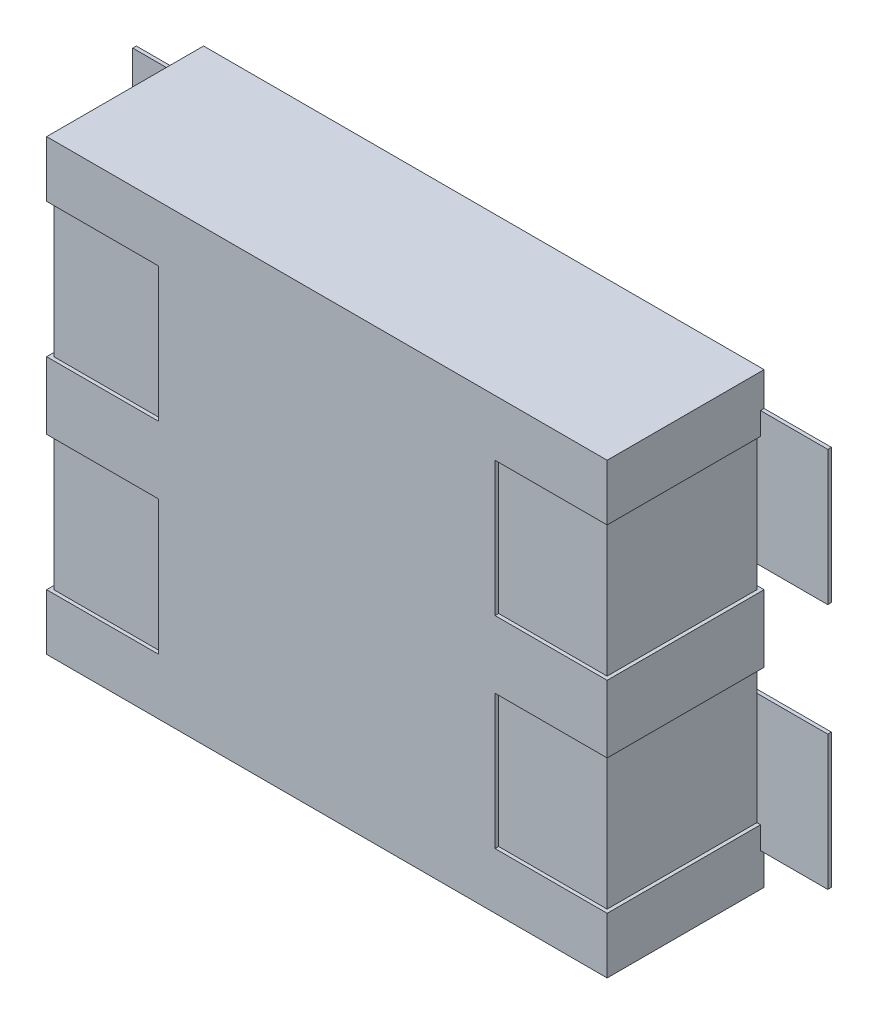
ISO-10303-21;
HEADER;
FILE_DESCRIPTION(('STEP AP214'),'2;1');
FILE_NAME('part.step','',(''),(''),'','','');
FILE_SCHEMA(('AUTOMOTIVE_DESIGN { 1 0 10303 214 1 1 1 1 }'));
ENDSEC;
DATA;
#1=APPLICATION_CONTEXT('core data for automotive mechanical design processes');
#2=APPLICATION_PROTOCOL_DEFINITION('international standard','automotive_design',2000,#1);
#3=PRODUCT_CONTEXT('',#1,'mechanical');
#4=PRODUCT('Part','Part','',(#3));
#5=PRODUCT_RELATED_PRODUCT_CATEGORY('part','',(#4));
#6=PRODUCT_DEFINITION_FORMATION('','',#4);
#7=PRODUCT_DEFINITION_CONTEXT('part definition',#1,'design');
#8=PRODUCT_DEFINITION('design','',#6,#7);
#9=PRODUCT_DEFINITION_SHAPE('','',#8);
#10=(LENGTH_UNIT() NAMED_UNIT(*) SI_UNIT(.MILLI.,.METRE.));
#11=(NAMED_UNIT(*) PLANE_ANGLE_UNIT() SI_UNIT($,.RADIAN.));
#12=(NAMED_UNIT(*) SI_UNIT($,.STERADIAN.) SOLID_ANGLE_UNIT());
#13=UNCERTAINTY_MEASURE_WITH_UNIT(LENGTH_MEASURE(1.E-05),#10,'distance_accuracy_value','');
#14=(GEOMETRIC_REPRESENTATION_CONTEXT(3) GLOBAL_UNCERTAINTY_ASSIGNED_CONTEXT((#13)) GLOBAL_UNIT_ASSIGNED_CONTEXT((#10,
#11,#12)) REPRESENTATION_CONTEXT('',''));
#15=CARTESIAN_POINT('',(0.,0.,0.));
#16=DIRECTION('',(0.,0.,1.));
#17=DIRECTION('',(1.,0.,0.));
#18=AXIS2_PLACEMENT_3D('',#15,#16,#17);
#19=CARTESIAN_POINT('',(-0.62500000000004,0.375000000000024,0.418212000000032));
#20=DIRECTION('',(0.,1.,0.));
#21=DIRECTION('',(0.,0.,1.));
#22=AXIS2_PLACEMENT_3D('',#19,#20,#21);
#23=PLANE('',#22);
#24=DIRECTION('',(-1.,0.,0.));
#25=VECTOR('',#24,1.);
#26=CARTESIAN_POINT('',(-0.62500000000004,0.375000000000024,0.418212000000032));
#27=LINE('',#26,#25);
#28=CARTESIAN_POINT('',(-0.617000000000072,0.375000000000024,0.418212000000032));
#29=VERTEX_POINT('',#28);
#30=CARTESIAN_POINT('',(-0.375000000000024,0.375000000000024,0.418212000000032));
#31=VERTEX_POINT('',#30);
#32=EDGE_CURVE('E355',#29,#31,#27,.F.);
#33=ORIENTED_EDGE('',*,*,#32,.T.);
#34=DIRECTION('',(0.,0.,1.));
#35=VECTOR('',#34,1.);
#36=CARTESIAN_POINT('',(-0.375000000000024,0.375000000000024,0.418212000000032));
#37=LINE('',#36,#35);
#38=CARTESIAN_POINT('',(-0.375000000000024,0.375000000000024,0.426212));
#39=VERTEX_POINT('',#38);
#40=EDGE_CURVE('E359',#39,#31,#37,.F.);
#41=ORIENTED_EDGE('',*,*,#40,.F.);
#42=DIRECTION('',(1.,0.,0.));
#43=VECTOR('',#42,1.);
#44=CARTESIAN_POINT('',(0.,0.375000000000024,0.426212));
#45=LINE('',#44,#43);
#46=CARTESIAN_POINT('',(-0.62500000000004,0.375000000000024,0.426212));
#47=VERTEX_POINT('',#46);
#48=EDGE_CURVE('E424',#47,#39,#45,.T.);
#49=ORIENTED_EDGE('',*,*,#48,.F.);
#50=DIRECTION('',(0.,0.,1.));
#51=VECTOR('',#50,1.);
#52=CARTESIAN_POINT('',(-0.62500000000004,0.375000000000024,0.0762));
#53=LINE('',#52,#51);
#54=CARTESIAN_POINT('',(-0.62500000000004,0.375000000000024,0.0841999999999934));
#55=VERTEX_POINT('',#54);
#56=EDGE_CURVE('E337',#55,#47,#53,.T.);
#57=ORIENTED_EDGE('',*,*,#56,.F.);
#58=DIRECTION('',(1.,0.,0.));
#59=VECTOR('',#58,1.);
#60=CARTESIAN_POINT('',(0.,0.375000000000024,0.0841999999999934));
#61=LINE('',#60,#59);
#62=CARTESIAN_POINT('',(-0.617000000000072,0.375000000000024,0.0841999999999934));
#63=VERTEX_POINT('',#62);
#64=EDGE_CURVE('E19',#63,#55,#61,.F.);
#65=ORIENTED_EDGE('',*,*,#64,.F.);
#66=DIRECTION('',(0.,0.,-1.));
#67=VECTOR('',#66,1.);
#68=CARTESIAN_POINT('',(-0.617000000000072,0.375000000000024,0.0762));
#69=LINE('',#68,#67);
#70=EDGE_CURVE('E334',#63,#29,#69,.F.);
#71=ORIENTED_EDGE('',*,*,#70,.T.);
#72=EDGE_LOOP('',(#33,#41,#49,#57,#65,#71));
#73=FACE_BOUND('',#72,.T.);
#74=ADVANCED_FACE('F16',(#73),#23,.F.);
#75=CARTESIAN_POINT('',(0.,0.,0.0841999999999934));
#76=DIRECTION('',(0.,0.,1.));
#77=DIRECTION('',(1.,0.,0.));
#78=AXIS2_PLACEMENT_3D('',#75,#76,#77);
#79=PLANE('',#78);
#80=ORIENTED_EDGE('',*,*,#64,.T.);
#81=DIRECTION('',(0.,1.,0.));
#82=VECTOR('',#81,1.);
#83=CARTESIAN_POINT('',(-0.62500000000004,0.500000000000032,0.0841999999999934));
#84=LINE('',#83,#82);
#85=CARTESIAN_POINT('',(-0.62500000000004,0.425000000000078,0.0841999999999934));
#86=VERTEX_POINT('',#85);
#87=EDGE_CURVE('E443',#86,#55,#84,.F.);
#88=ORIENTED_EDGE('',*,*,#87,.F.);
#89=DIRECTION('',(1.,0.,0.));
#90=VECTOR('',#89,1.);
#91=CARTESIAN_POINT('',(-0.274999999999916,0.425000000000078,0.0841999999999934));
#92=LINE('',#91,#90);
#93=CARTESIAN_POINT('',(-0.774999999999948,0.425000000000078,0.0841999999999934));
#94=VERTEX_POINT('',#93);
#95=EDGE_CURVE('E445',#94,#86,#92,.T.);
#96=ORIENTED_EDGE('',*,*,#95,.F.);
#97=DIRECTION('',(0.,1.,0.));
#98=VECTOR('',#97,1.);
#99=CARTESIAN_POINT('',(-0.774999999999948,0.425000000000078,0.0841999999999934));
#100=LINE('',#99,#98);
#101=CARTESIAN_POINT('',(-0.774999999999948,0.125000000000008,0.0841999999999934));
#102=VERTEX_POINT('',#101);
#103=EDGE_CURVE('E449',#102,#94,#100,.T.);
#104=ORIENTED_EDGE('',*,*,#103,.F.);
#105=DIRECTION('',(1.,0.,0.));
#106=VECTOR('',#105,1.);
#107=CARTESIAN_POINT('',(-0.774999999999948,0.125000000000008,0.0841999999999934));
#108=LINE('',#107,#106);
#109=CARTESIAN_POINT('',(-0.617000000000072,0.125000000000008,0.0841999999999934));
#110=VERTEX_POINT('',#109);
#111=EDGE_CURVE('E349',#110,#102,#108,.F.);
#112=ORIENTED_EDGE('',*,*,#111,.F.);
#113=DIRECTION('',(0.,1.,0.));
#114=VECTOR('',#113,1.);
#115=CARTESIAN_POINT('',(-0.617000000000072,0.0750000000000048,0.0841999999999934));
#116=LINE('',#115,#114);
#117=EDGE_CURVE('E329',#110,#63,#116,.T.);
#118=ORIENTED_EDGE('',*,*,#117,.T.);
#119=EDGE_LOOP('',(#80,#88,#96,#104,#112,#118));
#120=FACE_BOUND('',#119,.T.);
#121=ADVANCED_FACE('F347',(#120),#79,.T.);
#122=CARTESIAN_POINT('',(0.62500000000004,0.0750000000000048,0.0841999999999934));
#123=DIRECTION('',(0.,0.,1.));
#124=DIRECTION('',(1.,0.,0.));
#125=AXIS2_PLACEMENT_3D('',#122,#123,#124);
#126=PLANE('',#125);
#127=DIRECTION('',(1.,0.,0.));
#128=VECTOR('',#127,1.);
#129=CARTESIAN_POINT('',(-0.62500000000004,0.0750000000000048,0.0841999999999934));
#130=LINE('',#129,#128);
#131=CARTESIAN_POINT('',(-0.375000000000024,0.0750000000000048,0.0841999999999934));
#132=VERTEX_POINT('',#131);
#133=CARTESIAN_POINT('',(-0.617000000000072,0.0750000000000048,0.0841999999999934));
#134=VERTEX_POINT('',#133);
#135=EDGE_CURVE('E465',#132,#134,#130,.F.);
#136=ORIENTED_EDGE('',*,*,#135,.T.);
#137=DIRECTION('',(0.,1.,0.));
#138=VECTOR('',#137,1.);
#139=CARTESIAN_POINT('',(-0.617000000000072,0.0750000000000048,0.0841999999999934));
#140=LINE('',#139,#138);
#141=EDGE_CURVE('E345',#134,#110,#140,.T.);
#142=ORIENTED_EDGE('',*,*,#141,.T.);
#143=DIRECTION('',(1.,0.,0.));
#144=VECTOR('',#143,1.);
#145=CARTESIAN_POINT('',(-0.774999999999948,0.125000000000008,0.0841999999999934));
#146=LINE('',#145,#144);
#147=CARTESIAN_POINT('',(-0.375000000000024,0.125000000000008,0.0841999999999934));
#148=VERTEX_POINT('',#147);
#149=EDGE_CURVE('E453',#148,#110,#146,.F.);
#150=ORIENTED_EDGE('',*,*,#149,.F.);
#151=DIRECTION('',(0.,1.,0.));
#152=VECTOR('',#151,1.);
#153=CARTESIAN_POINT('',(-0.375000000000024,0.375000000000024,0.0841999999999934));
#154=LINE('',#153,#152);
#155=EDGE_CURVE('E458',#132,#148,#154,.T.);
#156=ORIENTED_EDGE('',*,*,#155,.F.);
#157=EDGE_LOOP('',(#136,#142,#150,#156));
#158=FACE_BOUND('',#157,.T.);
#159=ADVANCED_FACE('F1005',(#158),#126,.F.);
#160=CARTESIAN_POINT('',(-0.617000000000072,0.0750000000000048,0.0762));
#161=DIRECTION('',(1.,0.,0.));
#162=DIRECTION('',(0.,0.,-1.));
#163=AXIS2_PLACEMENT_3D('',#160,#161,#162);
#164=PLANE('',#163);
#165=DIRECTION('',(0.,0.,-1.));
#166=VECTOR('',#165,1.);
#167=CARTESIAN_POINT('',(-0.617000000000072,0.0750000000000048,0.426212));
#168=LINE('',#167,#166);
#169=CARTESIAN_POINT('',(-0.617000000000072,0.0750000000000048,0.418212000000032));
#170=VERTEX_POINT('',#169);
#171=EDGE_CURVE('E468',#134,#170,#168,.F.);
#172=ORIENTED_EDGE('',*,*,#171,.T.);
#173=DIRECTION('',(0.,1.,0.));
#174=VECTOR('',#173,1.);
#175=CARTESIAN_POINT('',(-0.617000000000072,0.0750000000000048,0.418212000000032));
#176=LINE('',#175,#174);
#177=EDGE_CURVE('E344',#170,#29,#176,.T.);
#178=ORIENTED_EDGE('',*,*,#177,.T.);
#179=ORIENTED_EDGE('',*,*,#70,.F.);
#180=ORIENTED_EDGE('',*,*,#117,.F.);
#181=ORIENTED_EDGE('',*,*,#141,.F.);
#182=EDGE_LOOP('',(#172,#178,#179,#180,#181));
#183=FACE_BOUND('',#182,.T.);
#184=ADVANCED_FACE('F343',(#183),#164,.F.);
#185=CARTESIAN_POINT('',(-0.62500000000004,0.0750000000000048,0.418212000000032));
#186=DIRECTION('',(0.,0.,-1.));
#187=DIRECTION('',(-1.,0.,0.));
#188=AXIS2_PLACEMENT_3D('',#185,#186,#187);
#189=PLANE('',#188);
#190=ORIENTED_EDGE('',*,*,#177,.F.);
#191=DIRECTION('',(1.,0.,0.));
#192=VECTOR('',#191,1.);
#193=CARTESIAN_POINT('',(-0.62500000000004,0.0750000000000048,0.418212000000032));
#194=LINE('',#193,#192);
#195=CARTESIAN_POINT('',(-0.375000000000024,0.0750000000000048,0.418212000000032));
#196=VERTEX_POINT('',#195);
#197=EDGE_CURVE('E470',#170,#196,#194,.T.);
#198=ORIENTED_EDGE('',*,*,#197,.T.);
#199=DIRECTION('',(0.,1.,0.));
#200=VECTOR('',#199,1.);
#201=CARTESIAN_POINT('',(-0.375000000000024,0.375000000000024,0.418212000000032));
#202=LINE('',#201,#200);
#203=EDGE_CURVE('E357',#31,#196,#202,.F.);
#204=ORIENTED_EDGE('',*,*,#203,.F.);
#205=ORIENTED_EDGE('',*,*,#32,.F.);
#206=EDGE_LOOP('',(#190,#198,#204,#205));
#207=FACE_BOUND('',#206,.T.);
#208=ADVANCED_FACE('F998',(#207),#189,.F.);
#209=CARTESIAN_POINT('',(-0.375000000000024,0.375000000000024,0.418212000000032));
#210=DIRECTION('',(-1.,0.,0.));
#211=DIRECTION('',(0.,0.,1.));
#212=AXIS2_PLACEMENT_3D('',#209,#210,#211);
#213=PLANE('',#212);
#214=DIRECTION('',(0.,1.,0.));
#215=VECTOR('',#214,1.);
#216=CARTESIAN_POINT('',(-0.375000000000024,0.,0.426212));
#217=LINE('',#216,#215);
#218=CARTESIAN_POINT('',(-0.375000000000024,0.0750000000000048,0.426212));
#219=VERTEX_POINT('',#218);
#220=EDGE_CURVE('E426',#39,#219,#217,.F.);
#221=ORIENTED_EDGE('',*,*,#220,.F.);
#222=ORIENTED_EDGE('',*,*,#40,.T.);
#223=ORIENTED_EDGE('',*,*,#203,.T.);
#224=DIRECTION('',(0.,0.,-1.));
#225=VECTOR('',#224,1.);
#226=CARTESIAN_POINT('',(-0.375000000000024,0.0750000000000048,0.426212));
#227=LINE('',#226,#225);
#228=EDGE_CURVE('E473',#196,#219,#227,.F.);
#229=ORIENTED_EDGE('',*,*,#228,.T.);
#230=EDGE_LOOP('',(#221,#222,#223,#229));
#231=FACE_BOUND('',#230,.T.);
#232=ADVANCED_FACE('F994',(#231),#213,.T.);
#233=CARTESIAN_POINT('',(-0.375000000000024,-0.0750000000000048,0.418212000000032));
#234=DIRECTION('',(-1.,0.,0.));
#235=DIRECTION('',(0.,0.,1.));
#236=AXIS2_PLACEMENT_3D('',#233,#234,#235);
#237=PLANE('',#236);
#238=DIRECTION('',(0.,0.,1.));
#239=VECTOR('',#238,1.);
#240=CARTESIAN_POINT('',(-0.375000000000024,-0.0750000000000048,0.418212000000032));
#241=LINE('',#240,#239);
#242=CARTESIAN_POINT('',(-0.375000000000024,-0.0750000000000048,0.426212));
#243=VERTEX_POINT('',#242);
#244=CARTESIAN_POINT('',(-0.375000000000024,-0.0750000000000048,0.418212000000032));
#245=VERTEX_POINT('',#244);
#246=EDGE_CURVE('E489',#243,#245,#241,.F.);
#247=ORIENTED_EDGE('',*,*,#246,.T.);
#248=DIRECTION('',(0.,1.,0.));
#249=VECTOR('',#248,1.);
#250=CARTESIAN_POINT('',(-0.375000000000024,-0.375000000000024,0.418212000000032));
#251=LINE('',#250,#249);
#252=CARTESIAN_POINT('',(-0.375000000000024,-0.375000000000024,0.418212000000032));
#253=VERTEX_POINT('',#252);
#254=EDGE_CURVE('E362',#245,#253,#251,.F.);
#255=ORIENTED_EDGE('',*,*,#254,.T.);
#256=DIRECTION('',(0.,0.,-1.));
#257=VECTOR('',#256,1.);
#258=CARTESIAN_POINT('',(-0.375000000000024,-0.375000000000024,0.426212));
#259=LINE('',#258,#257);
#260=CARTESIAN_POINT('',(-0.375000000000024,-0.375000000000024,0.426212));
#261=VERTEX_POINT('',#260);
#262=EDGE_CURVE('E375',#253,#261,#259,.F.);
#263=ORIENTED_EDGE('',*,*,#262,.T.);
#264=DIRECTION('',(0.,1.,0.));
#265=VECTOR('',#264,1.);
#266=CARTESIAN_POINT('',(-0.375000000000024,0.,0.426212));
#267=LINE('',#266,#265);
#268=EDGE_CURVE('E428',#243,#261,#267,.F.);
#269=ORIENTED_EDGE('',*,*,#268,.F.);
#270=EDGE_LOOP('',(#247,#255,#263,#269));
#271=FACE_BOUND('',#270,.T.);
#272=ADVANCED_FACE('F990',(#271),#237,.T.);
#273=CARTESIAN_POINT('',(-0.62500000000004,-0.375000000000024,0.418212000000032));
#274=DIRECTION('',(0.,0.,-1.));
#275=DIRECTION('',(-1.,0.,0.));
#276=AXIS2_PLACEMENT_3D('',#273,#274,#275);
#277=PLANE('',#276);
#278=DIRECTION('',(0.,1.,0.));
#279=VECTOR('',#278,1.);
#280=CARTESIAN_POINT('',(-0.617000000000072,-0.375000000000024,0.418212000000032));
#281=LINE('',#280,#279);
#282=CARTESIAN_POINT('',(-0.617000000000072,-0.0750000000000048,0.418212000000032));
#283=VERTEX_POINT('',#282);
#284=CARTESIAN_POINT('',(-0.617000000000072,-0.375000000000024,0.418212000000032));
#285=VERTEX_POINT('',#284);
#286=EDGE_CURVE('E364',#283,#285,#281,.F.);
#287=ORIENTED_EDGE('',*,*,#286,.T.);
#288=DIRECTION('',(1.,0.,0.));
#289=VECTOR('',#288,1.);
#290=CARTESIAN_POINT('',(-0.62500000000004,-0.375000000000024,0.418212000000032));
#291=LINE('',#290,#289);
#292=EDGE_CURVE('E372',#285,#253,#291,.T.);
#293=ORIENTED_EDGE('',*,*,#292,.T.);
#294=ORIENTED_EDGE('',*,*,#254,.F.);
#295=DIRECTION('',(1.,0.,0.));
#296=VECTOR('',#295,1.);
#297=CARTESIAN_POINT('',(-0.62500000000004,-0.0750000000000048,0.418212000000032));
#298=LINE('',#297,#296);
#299=EDGE_CURVE('E492',#245,#283,#298,.F.);
#300=ORIENTED_EDGE('',*,*,#299,.T.);
#301=EDGE_LOOP('',(#287,#293,#294,#300));
#302=FACE_BOUND('',#301,.T.);
#303=ADVANCED_FACE('F986',(#302),#277,.F.);
#304=CARTESIAN_POINT('',(-0.617000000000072,-0.375000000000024,0.0762));
#305=DIRECTION('',(1.,0.,0.));
#306=DIRECTION('',(0.,0.,-1.));
#307=AXIS2_PLACEMENT_3D('',#304,#305,#306);
#308=PLANE('',#307);
#309=ORIENTED_EDGE('',*,*,#286,.F.);
#310=DIRECTION('',(0.,0.,1.));
#311=VECTOR('',#310,1.);
#312=CARTESIAN_POINT('',(-0.617000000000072,-0.0750000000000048,0.418212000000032));
#313=LINE('',#312,#311);
#314=CARTESIAN_POINT('',(-0.617000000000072,-0.0750000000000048,0.0841999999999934));
#315=VERTEX_POINT('',#314);
#316=EDGE_CURVE('E495',#283,#315,#313,.F.);
#317=ORIENTED_EDGE('',*,*,#316,.T.);
#318=DIRECTION('',(0.,1.,0.));
#319=VECTOR('',#318,1.);
#320=CARTESIAN_POINT('',(-0.617000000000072,-0.375000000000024,0.0841999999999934));
#321=LINE('',#320,#319);
#322=CARTESIAN_POINT('',(-0.617000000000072,-0.125000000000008,0.0841999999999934));
#323=VERTEX_POINT('',#322);
#324=EDGE_CURVE('E366',#315,#323,#321,.F.);
#325=ORIENTED_EDGE('',*,*,#324,.T.);
#326=DIRECTION('',(0.,1.,0.));
#327=VECTOR('',#326,1.);
#328=CARTESIAN_POINT('',(-0.617000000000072,0.,0.0841999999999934));
#329=LINE('',#328,#327);
#330=CARTESIAN_POINT('',(-0.617000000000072,-0.375000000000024,0.0841999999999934));
#331=VERTEX_POINT('',#330);
#332=EDGE_CURVE('E381',#331,#323,#329,.T.);
#333=ORIENTED_EDGE('',*,*,#332,.F.);
#334=DIRECTION('',(0.,0.,-1.));
#335=VECTOR('',#334,1.);
#336=CARTESIAN_POINT('',(-0.617000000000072,-0.375000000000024,0.426212));
#337=LINE('',#336,#335);
#338=EDGE_CURVE('E369',#331,#285,#337,.F.);
#339=ORIENTED_EDGE('',*,*,#338,.T.);
#340=EDGE_LOOP('',(#309,#317,#325,#333,#339));
#341=FACE_BOUND('',#340,.T.);
#342=ADVANCED_FACE('F982',(#341),#308,.F.);
#343=CARTESIAN_POINT('',(0.62500000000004,-0.375000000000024,0.0841999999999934));
#344=DIRECTION('',(0.,0.,1.));
#345=DIRECTION('',(1.,0.,0.));
#346=AXIS2_PLACEMENT_3D('',#343,#344,#345);
#347=PLANE('',#346);
#348=DIRECTION('',(1.,0.,0.));
#349=VECTOR('',#348,1.);
#350=CARTESIAN_POINT('',(-0.62500000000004,-0.0750000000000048,0.0841999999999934));
#351=LINE('',#350,#349);
#352=CARTESIAN_POINT('',(-0.375000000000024,-0.0750000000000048,0.0841999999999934));
#353=VERTEX_POINT('',#352);
#354=EDGE_CURVE('E498',#315,#353,#351,.T.);
#355=ORIENTED_EDGE('',*,*,#354,.T.);
#356=DIRECTION('',(0.,1.,0.));
#357=VECTOR('',#356,1.);
#358=CARTESIAN_POINT('',(-0.375000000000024,-0.0750000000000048,0.0841999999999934));
#359=LINE('',#358,#357);
#360=CARTESIAN_POINT('',(-0.375000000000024,-0.125000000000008,0.0841999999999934));
#361=VERTEX_POINT('',#360);
#362=EDGE_CURVE('E501',#361,#353,#359,.T.);
#363=ORIENTED_EDGE('',*,*,#362,.F.);
#364=DIRECTION('',(1.,0.,0.));
#365=VECTOR('',#364,1.);
#366=CARTESIAN_POINT('',(-0.274999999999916,-0.125000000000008,0.0841999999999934));
#367=LINE('',#366,#365);
#368=EDGE_CURVE('E508',#323,#361,#367,.T.);
#369=ORIENTED_EDGE('',*,*,#368,.F.);
#370=ORIENTED_EDGE('',*,*,#324,.F.);
#371=EDGE_LOOP('',(#355,#363,#369,#370));
#372=FACE_BOUND('',#371,.T.);
#373=ADVANCED_FACE('F978',(#372),#347,.F.);
#374=CARTESIAN_POINT('',(-0.62500000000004,-0.375000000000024,0.426212));
#375=DIRECTION('',(0.,-1.,0.));
#376=DIRECTION('',(0.,0.,-1.));
#377=AXIS2_PLACEMENT_3D('',#374,#375,#376);
#378=PLANE('',#377);
#379=DIRECTION('',(1.,0.,0.));
#380=VECTOR('',#379,1.);
#381=CARTESIAN_POINT('',(0.,-0.375000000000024,0.426212));
#382=LINE('',#381,#380);
#383=CARTESIAN_POINT('',(-0.62500000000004,-0.375000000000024,0.426212));
#384=VERTEX_POINT('',#383);
#385=EDGE_CURVE('E430',#261,#384,#382,.F.);
#386=ORIENTED_EDGE('',*,*,#385,.F.);
#387=ORIENTED_EDGE('',*,*,#262,.F.);
#388=ORIENTED_EDGE('',*,*,#292,.F.);
#389=ORIENTED_EDGE('',*,*,#338,.F.);
#390=DIRECTION('',(1.,0.,0.));
#391=VECTOR('',#390,1.);
#392=CARTESIAN_POINT('',(0.,-0.375000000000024,0.0841999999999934));
#393=LINE('',#392,#391);
#394=CARTESIAN_POINT('',(-0.62500000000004,-0.375000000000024,0.0841999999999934));
#395=VERTEX_POINT('',#394);
#396=EDGE_CURVE('E378',#395,#331,#393,.T.);
#397=ORIENTED_EDGE('',*,*,#396,.F.);
#398=DIRECTION('',(0.,0.,1.));
#399=VECTOR('',#398,1.);
#400=CARTESIAN_POINT('',(-0.62500000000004,-0.375000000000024,0.0762));
#401=LINE('',#400,#399);
#402=EDGE_CURVE('E525',#384,#395,#401,.F.);
#403=ORIENTED_EDGE('',*,*,#402,.F.);
#404=EDGE_LOOP('',(#386,#387,#388,#389,#397,#403));
#405=FACE_BOUND('',#404,.T.);
#406=ADVANCED_FACE('F974',(#405),#378,.F.);
#407=CARTESIAN_POINT('',(0.,0.,0.0841999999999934));
#408=DIRECTION('',(0.,0.,1.));
#409=DIRECTION('',(1.,0.,0.));
#410=AXIS2_PLACEMENT_3D('',#407,#408,#409);
#411=PLANE('',#410);
#412=DIRECTION('',(1.,0.,0.));
#413=VECTOR('',#412,1.);
#414=CARTESIAN_POINT('',(-0.774999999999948,-0.425000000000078,0.0841999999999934));
#415=LINE('',#414,#413);
#416=CARTESIAN_POINT('',(-0.62500000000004,-0.425000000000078,0.0841999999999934));
#417=VERTEX_POINT('',#416);
#418=CARTESIAN_POINT('',(-0.774999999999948,-0.425000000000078,0.0841999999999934));
#419=VERTEX_POINT('',#418);
#420=EDGE_CURVE('E516',#417,#419,#415,.F.);
#421=ORIENTED_EDGE('',*,*,#420,.F.);
#422=DIRECTION('',(0.,1.,0.));
#423=VECTOR('',#422,1.);
#424=CARTESIAN_POINT('',(-0.62500000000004,0.500000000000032,0.0841999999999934));
#425=LINE('',#424,#423);
#426=EDGE_CURVE('E527',#395,#417,#425,.F.);
#427=ORIENTED_EDGE('',*,*,#426,.F.);
#428=ORIENTED_EDGE('',*,*,#396,.T.);
#429=ORIENTED_EDGE('',*,*,#332,.T.);
#430=DIRECTION('',(1.,0.,0.));
#431=VECTOR('',#430,1.);
#432=CARTESIAN_POINT('',(-0.274999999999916,-0.125000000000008,0.0841999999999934));
#433=LINE('',#432,#431);
#434=CARTESIAN_POINT('',(-0.774999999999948,-0.125000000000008,0.0841999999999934));
#435=VERTEX_POINT('',#434);
#436=EDGE_CURVE('E505',#435,#323,#433,.T.);
#437=ORIENTED_EDGE('',*,*,#436,.F.);
#438=DIRECTION('',(0.,1.,0.));
#439=VECTOR('',#438,1.);
#440=CARTESIAN_POINT('',(-0.774999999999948,-0.125000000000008,0.0841999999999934));
#441=LINE('',#440,#439);
#442=EDGE_CURVE('E512',#419,#435,#441,.T.);
#443=ORIENTED_EDGE('',*,*,#442,.F.);
#444=EDGE_LOOP('',(#421,#427,#428,#429,#437,#443));
#445=FACE_BOUND('',#444,.T.);
#446=ADVANCED_FACE('F970',(#445),#411,.T.);
#447=CARTESIAN_POINT('',(-0.62500000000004,-0.375000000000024,0.426212));
#448=DIRECTION('',(0.,-1.,0.));
#449=DIRECTION('',(0.,0.,-1.));
#450=AXIS2_PLACEMENT_3D('',#447,#448,#449);
#451=PLANE('',#450);
#452=DIRECTION('',(-1.,0.,0.));
#453=VECTOR('',#452,1.);
#454=CARTESIAN_POINT('',(-0.62500000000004,-0.375000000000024,0.418212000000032));
#455=LINE('',#454,#453);
#456=CARTESIAN_POINT('',(0.617000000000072,-0.375000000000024,0.418212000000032));
#457=VERTEX_POINT('',#456);
#458=CARTESIAN_POINT('',(0.375000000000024,-0.375000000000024,0.418212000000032));
#459=VERTEX_POINT('',#458);
#460=EDGE_CURVE('E396',#457,#459,#455,.T.);
#461=ORIENTED_EDGE('',*,*,#460,.T.);
#462=DIRECTION('',(0.,0.,-1.));
#463=VECTOR('',#462,1.);
#464=CARTESIAN_POINT('',(0.375000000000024,-0.375000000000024,0.418212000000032));
#465=LINE('',#464,#463);
#466=CARTESIAN_POINT('',(0.375000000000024,-0.375000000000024,0.426212));
#467=VERTEX_POINT('',#466);
#468=EDGE_CURVE('E399',#467,#459,#465,.T.);
#469=ORIENTED_EDGE('',*,*,#468,.F.);
#470=DIRECTION('',(1.,0.,0.));
#471=VECTOR('',#470,1.);
#472=CARTESIAN_POINT('',(0.,-0.375000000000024,0.426212));
#473=LINE('',#472,#471);
#474=CARTESIAN_POINT('',(0.62500000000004,-0.375000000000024,0.426212));
#475=VERTEX_POINT('',#474);
#476=EDGE_CURVE('E432',#475,#467,#473,.F.);
#477=ORIENTED_EDGE('',*,*,#476,.F.);
#478=DIRECTION('',(0.,0.,-1.));
#479=VECTOR('',#478,1.);
#480=CARTESIAN_POINT('',(0.62500000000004,-0.375000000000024,0.0762));
#481=LINE('',#480,#479);
#482=CARTESIAN_POINT('',(0.62500000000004,-0.375000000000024,0.0841999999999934));
#483=VERTEX_POINT('',#482);
#484=EDGE_CURVE('E534',#483,#475,#481,.F.);
#485=ORIENTED_EDGE('',*,*,#484,.F.);
#486=DIRECTION('',(1.,0.,0.));
#487=VECTOR('',#486,1.);
#488=CARTESIAN_POINT('',(0.,-0.375000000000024,0.0841999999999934));
#489=LINE('',#488,#487);
#490=CARTESIAN_POINT('',(0.617000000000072,-0.375000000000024,0.0841999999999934));
#491=VERTEX_POINT('',#490);
#492=EDGE_CURVE('E383',#491,#483,#489,.T.);
#493=ORIENTED_EDGE('',*,*,#492,.F.);
#494=DIRECTION('',(0.,0.,1.));
#495=VECTOR('',#494,1.);
#496=CARTESIAN_POINT('',(0.617000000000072,-0.375000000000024,0.426212));
#497=LINE('',#496,#495);
#498=EDGE_CURVE('E388',#491,#457,#497,.T.);
#499=ORIENTED_EDGE('',*,*,#498,.T.);
#500=EDGE_LOOP('',(#461,#469,#477,#485,#493,#499));
#501=FACE_BOUND('',#500,.T.);
#502=ADVANCED_FACE('F966',(#501),#451,.F.);
#503=CARTESIAN_POINT('',(0.,0.,0.0841999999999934));
#504=DIRECTION('',(0.,0.,1.));
#505=DIRECTION('',(1.,0.,0.));
#506=AXIS2_PLACEMENT_3D('',#503,#504,#505);
#507=PLANE('',#506);
#508=ORIENTED_EDGE('',*,*,#492,.T.);
#509=DIRECTION('',(0.,1.,0.));
#510=VECTOR('',#509,1.);
#511=CARTESIAN_POINT('',(0.62500000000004,-0.500000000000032,0.0841999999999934));
#512=LINE('',#511,#510);
#513=CARTESIAN_POINT('',(0.62500000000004,-0.425000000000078,0.0841999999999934));
#514=VERTEX_POINT('',#513);
#515=EDGE_CURVE('E540',#514,#483,#512,.T.);
#516=ORIENTED_EDGE('',*,*,#515,.F.);
#517=DIRECTION('',(1.,0.,0.));
#518=VECTOR('',#517,1.);
#519=CARTESIAN_POINT('',(0.274999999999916,-0.425000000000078,0.0841999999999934));
#520=LINE('',#519,#518);
#521=CARTESIAN_POINT('',(0.774999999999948,-0.425000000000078,0.0841999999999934));
#522=VERTEX_POINT('',#521);
#523=EDGE_CURVE('E543',#522,#514,#520,.F.);
#524=ORIENTED_EDGE('',*,*,#523,.F.);
#525=DIRECTION('',(0.,1.,0.));
#526=VECTOR('',#525,1.);
#527=CARTESIAN_POINT('',(0.774999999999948,-0.425000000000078,0.0841999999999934));
#528=LINE('',#527,#526);
#529=CARTESIAN_POINT('',(0.774999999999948,-0.125000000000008,0.0841999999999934));
#530=VERTEX_POINT('',#529);
#531=EDGE_CURVE('E547',#530,#522,#528,.F.);
#532=ORIENTED_EDGE('',*,*,#531,.F.);
#533=DIRECTION('',(1.,0.,0.));
#534=VECTOR('',#533,1.);
#535=CARTESIAN_POINT('',(0.774999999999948,-0.125000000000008,0.0841999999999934));
#536=LINE('',#535,#534);
#537=CARTESIAN_POINT('',(0.617000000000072,-0.125000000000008,0.0841999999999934));
#538=VERTEX_POINT('',#537);
#539=EDGE_CURVE('E554',#538,#530,#536,.T.);
#540=ORIENTED_EDGE('',*,*,#539,.F.);
#541=DIRECTION('',(0.,1.,0.));
#542=VECTOR('',#541,1.);
#543=CARTESIAN_POINT('',(0.617000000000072,-0.375000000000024,0.0841999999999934));
#544=LINE('',#543,#542);
#545=EDGE_CURVE('E385',#538,#491,#544,.F.);
#546=ORIENTED_EDGE('',*,*,#545,.T.);
#547=EDGE_LOOP('',(#508,#516,#524,#532,#540,#546));
#548=FACE_BOUND('',#547,.T.);
#549=ADVANCED_FACE('F962',(#548),#507,.T.);
#550=CARTESIAN_POINT('',(0.62500000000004,-0.375000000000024,0.0841999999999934));
#551=DIRECTION('',(0.,0.,1.));
#552=DIRECTION('',(1.,0.,0.));
#553=AXIS2_PLACEMENT_3D('',#550,#551,#552);
#554=PLANE('',#553);
#555=DIRECTION('',(1.,0.,0.));
#556=VECTOR('',#555,1.);
#557=CARTESIAN_POINT('',(-0.62500000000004,-0.0750000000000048,0.0841999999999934));
#558=LINE('',#557,#556);
#559=CARTESIAN_POINT('',(0.375000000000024,-0.0750000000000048,0.0841999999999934));
#560=VERTEX_POINT('',#559);
#561=CARTESIAN_POINT('',(0.617000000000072,-0.0750000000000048,0.0841999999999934));
#562=VERTEX_POINT('',#561);
#563=EDGE_CURVE('E565',#560,#562,#558,.T.);
#564=ORIENTED_EDGE('',*,*,#563,.T.);
#565=DIRECTION('',(0.,1.,0.));
#566=VECTOR('',#565,1.);
#567=CARTESIAN_POINT('',(0.617000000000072,-0.375000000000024,0.0841999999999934));
#568=LINE('',#567,#566);
#569=EDGE_CURVE('E390',#562,#538,#568,.F.);
#570=ORIENTED_EDGE('',*,*,#569,.T.);
#571=DIRECTION('',(1.,0.,0.));
#572=VECTOR('',#571,1.);
#573=CARTESIAN_POINT('',(0.774999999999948,-0.125000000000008,0.0841999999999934));
#574=LINE('',#573,#572);
#575=CARTESIAN_POINT('',(0.375000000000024,-0.125000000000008,0.0841999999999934));
#576=VERTEX_POINT('',#575);
#577=EDGE_CURVE('E551',#576,#538,#574,.T.);
#578=ORIENTED_EDGE('',*,*,#577,.F.);
#579=DIRECTION('',(0.,1.,0.));
#580=VECTOR('',#579,1.);
#581=CARTESIAN_POINT('',(0.375000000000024,-0.375000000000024,0.0841999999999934));
#582=LINE('',#581,#580);
#583=EDGE_CURVE('E558',#560,#576,#582,.F.);
#584=ORIENTED_EDGE('',*,*,#583,.F.);
#585=EDGE_LOOP('',(#564,#570,#578,#584));
#586=FACE_BOUND('',#585,.T.);
#587=ADVANCED_FACE('F958',(#586),#554,.F.);
#588=CARTESIAN_POINT('',(0.617000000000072,-0.375000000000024,0.426212));
#589=DIRECTION('',(-1.,0.,0.));
#590=DIRECTION('',(0.,0.,1.));
#591=AXIS2_PLACEMENT_3D('',#588,#589,#590);
#592=PLANE('',#591);
#593=DIRECTION('',(0.,0.,1.));
#594=VECTOR('',#593,1.);
#595=CARTESIAN_POINT('',(0.617000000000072,-0.0750000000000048,0.418212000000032));
#596=LINE('',#595,#594);
#597=CARTESIAN_POINT('',(0.617000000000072,-0.0750000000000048,0.418212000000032));
#598=VERTEX_POINT('',#597);
#599=EDGE_CURVE('E568',#562,#598,#596,.T.);
#600=ORIENTED_EDGE('',*,*,#599,.T.);
#601=DIRECTION('',(0.,1.,0.));
#602=VECTOR('',#601,1.);
#603=CARTESIAN_POINT('',(0.617000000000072,-0.375000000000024,0.418212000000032));
#604=LINE('',#603,#602);
#605=EDGE_CURVE('E393',#598,#457,#604,.F.);
#606=ORIENTED_EDGE('',*,*,#605,.T.);
#607=ORIENTED_EDGE('',*,*,#498,.F.);
#608=ORIENTED_EDGE('',*,*,#545,.F.);
#609=ORIENTED_EDGE('',*,*,#569,.F.);
#610=EDGE_LOOP('',(#600,#606,#607,#608,#609));
#611=FACE_BOUND('',#610,.T.);
#612=ADVANCED_FACE('F954',(#611),#592,.F.);
#613=CARTESIAN_POINT('',(-0.62500000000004,-0.375000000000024,0.418212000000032));
#614=DIRECTION('',(0.,0.,-1.));
#615=DIRECTION('',(-1.,0.,0.));
#616=AXIS2_PLACEMENT_3D('',#613,#614,#615);
#617=PLANE('',#616);
#618=ORIENTED_EDGE('',*,*,#605,.F.);
#619=DIRECTION('',(1.,0.,0.));
#620=VECTOR('',#619,1.);
#621=CARTESIAN_POINT('',(-0.62500000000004,-0.0750000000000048,0.418212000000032));
#622=LINE('',#621,#620);
#623=CARTESIAN_POINT('',(0.375000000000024,-0.0750000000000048,0.418212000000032));
#624=VERTEX_POINT('',#623);
#625=EDGE_CURVE('E571',#598,#624,#622,.F.);
#626=ORIENTED_EDGE('',*,*,#625,.T.);
#627=DIRECTION('',(0.,1.,0.));
#628=VECTOR('',#627,1.);
#629=CARTESIAN_POINT('',(0.375000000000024,-0.375000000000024,0.418212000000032));
#630=LINE('',#629,#628);
#631=EDGE_CURVE('E401',#459,#624,#630,.T.);
#632=ORIENTED_EDGE('',*,*,#631,.F.);
#633=ORIENTED_EDGE('',*,*,#460,.F.);
#634=EDGE_LOOP('',(#618,#626,#632,#633));
#635=FACE_BOUND('',#634,.T.);
#636=ADVANCED_FACE('F950',(#635),#617,.F.);
#637=CARTESIAN_POINT('',(0.375000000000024,-0.375000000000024,0.418212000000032));
#638=DIRECTION('',(1.,0.,0.));
#639=DIRECTION('',(0.,0.,-1.));
#640=AXIS2_PLACEMENT_3D('',#637,#638,#639);
#641=PLANE('',#640);
#642=ORIENTED_EDGE('',*,*,#468,.T.);
#643=ORIENTED_EDGE('',*,*,#631,.T.);
#644=DIRECTION('',(0.,0.,1.));
#645=VECTOR('',#644,1.);
#646=CARTESIAN_POINT('',(0.375000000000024,-0.0750000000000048,0.418212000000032));
#647=LINE('',#646,#645);
#648=CARTESIAN_POINT('',(0.375000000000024,-0.0750000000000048,0.426212));
#649=VERTEX_POINT('',#648);
#650=EDGE_CURVE('E574',#624,#649,#647,.T.);
#651=ORIENTED_EDGE('',*,*,#650,.T.);
#652=DIRECTION('',(0.,1.,0.));
#653=VECTOR('',#652,1.);
#654=CARTESIAN_POINT('',(0.375000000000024,0.,0.426212));
#655=LINE('',#654,#653);
#656=EDGE_CURVE('E434',#467,#649,#655,.T.);
#657=ORIENTED_EDGE('',*,*,#656,.F.);
#658=EDGE_LOOP('',(#642,#643,#651,#657));
#659=FACE_BOUND('',#658,.T.);
#660=ADVANCED_FACE('F946',(#659),#641,.T.);
#661=CARTESIAN_POINT('',(0.375000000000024,0.0750000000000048,0.418212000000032));
#662=DIRECTION('',(1.,0.,0.));
#663=DIRECTION('',(0.,0.,-1.));
#664=AXIS2_PLACEMENT_3D('',#661,#662,#663);
#665=PLANE('',#664);
#666=DIRECTION('',(0.,1.,0.));
#667=VECTOR('',#666,1.);
#668=CARTESIAN_POINT('',(0.375000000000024,0.0750000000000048,0.418212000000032));
#669=LINE('',#668,#667);
#670=CARTESIAN_POINT('',(0.375000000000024,0.0750000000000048,0.418212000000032));
#671=VERTEX_POINT('',#670);
#672=CARTESIAN_POINT('',(0.375000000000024,0.375000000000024,0.418212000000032));
#673=VERTEX_POINT('',#672);
#674=EDGE_CURVE('E403',#671,#673,#669,.T.);
#675=ORIENTED_EDGE('',*,*,#674,.T.);
#676=DIRECTION('',(0.,0.,1.));
#677=VECTOR('',#676,1.);
#678=CARTESIAN_POINT('',(0.375000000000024,0.375000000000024,0.418212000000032));
#679=LINE('',#678,#677);
#680=CARTESIAN_POINT('',(0.375000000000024,0.375000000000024,0.426212));
#681=VERTEX_POINT('',#680);
#682=EDGE_CURVE('E416',#673,#681,#679,.T.);
#683=ORIENTED_EDGE('',*,*,#682,.T.);
#684=DIRECTION('',(0.,1.,0.));
#685=VECTOR('',#684,1.);
#686=CARTESIAN_POINT('',(0.375000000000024,0.,0.426212));
#687=LINE('',#686,#685);
#688=CARTESIAN_POINT('',(0.375000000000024,0.0750000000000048,0.426212));
#689=VERTEX_POINT('',#688);
#690=EDGE_CURVE('E436',#689,#681,#687,.T.);
#691=ORIENTED_EDGE('',*,*,#690,.F.);
#692=DIRECTION('',(0.,0.,-1.));
#693=VECTOR('',#692,1.);
#694=CARTESIAN_POINT('',(0.375000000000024,0.0750000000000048,0.426212));
#695=LINE('',#694,#693);
#696=EDGE_CURVE('E590',#689,#671,#695,.T.);
#697=ORIENTED_EDGE('',*,*,#696,.T.);
#698=EDGE_LOOP('',(#675,#683,#691,#697));
#699=FACE_BOUND('',#698,.T.);
#700=ADVANCED_FACE('F942',(#699),#665,.T.);
#701=CARTESIAN_POINT('',(-0.62500000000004,0.0750000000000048,0.418212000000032));
#702=DIRECTION('',(0.,0.,-1.));
#703=DIRECTION('',(-1.,0.,0.));
#704=AXIS2_PLACEMENT_3D('',#701,#702,#703);
#705=PLANE('',#704);
#706=DIRECTION('',(0.,1.,0.));
#707=VECTOR('',#706,1.);
#708=CARTESIAN_POINT('',(0.617000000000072,0.0750000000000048,0.418212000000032));
#709=LINE('',#708,#707);
#710=CARTESIAN_POINT('',(0.617000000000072,0.0750000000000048,0.418212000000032));
#711=VERTEX_POINT('',#710);
#712=CARTESIAN_POINT('',(0.617000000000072,0.375000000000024,0.418212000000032));
#713=VERTEX_POINT('',#712);
#714=EDGE_CURVE('E405',#711,#713,#709,.T.);
#715=ORIENTED_EDGE('',*,*,#714,.T.);
#716=DIRECTION('',(1.,0.,0.));
#717=VECTOR('',#716,1.);
#718=CARTESIAN_POINT('',(-0.62500000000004,0.375000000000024,0.418212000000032));
#719=LINE('',#718,#717);
#720=EDGE_CURVE('E413',#713,#673,#719,.F.);
#721=ORIENTED_EDGE('',*,*,#720,.T.);
#722=ORIENTED_EDGE('',*,*,#674,.F.);
#723=DIRECTION('',(1.,0.,0.));
#724=VECTOR('',#723,1.);
#725=CARTESIAN_POINT('',(-0.62500000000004,0.0750000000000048,0.418212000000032));
#726=LINE('',#725,#724);
#727=EDGE_CURVE('E593',#671,#711,#726,.T.);
#728=ORIENTED_EDGE('',*,*,#727,.T.);
#729=EDGE_LOOP('',(#715,#721,#722,#728));
#730=FACE_BOUND('',#729,.T.);
#731=ADVANCED_FACE('F938',(#730),#705,.F.);
#732=CARTESIAN_POINT('',(0.617000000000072,0.0750000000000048,0.426212));
#733=DIRECTION('',(-1.,0.,0.));
#734=DIRECTION('',(0.,0.,1.));
#735=AXIS2_PLACEMENT_3D('',#732,#733,#734);
#736=PLANE('',#735);
#737=ORIENTED_EDGE('',*,*,#714,.F.);
#738=DIRECTION('',(0.,0.,-1.));
#739=VECTOR('',#738,1.);
#740=CARTESIAN_POINT('',(0.617000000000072,0.0750000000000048,0.426212));
#741=LINE('',#740,#739);
#742=CARTESIAN_POINT('',(0.617000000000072,0.0750000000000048,0.0841999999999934));
#743=VERTEX_POINT('',#742);
#744=EDGE_CURVE('E596',#711,#743,#741,.T.);
#745=ORIENTED_EDGE('',*,*,#744,.T.);
#746=DIRECTION('',(0.,1.,0.));
#747=VECTOR('',#746,1.);
#748=CARTESIAN_POINT('',(0.617000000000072,0.0750000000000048,0.0841999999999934));
#749=LINE('',#748,#747);
#750=CARTESIAN_POINT('',(0.617000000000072,0.125000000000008,0.0841999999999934));
#751=VERTEX_POINT('',#750);
#752=EDGE_CURVE('E407',#743,#751,#749,.T.);
#753=ORIENTED_EDGE('',*,*,#752,.T.);
#754=DIRECTION('',(0.,1.,0.));
#755=VECTOR('',#754,1.);
#756=CARTESIAN_POINT('',(0.617000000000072,0.,0.0841999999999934));
#757=LINE('',#756,#755);
#758=CARTESIAN_POINT('',(0.617000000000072,0.375000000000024,0.0841999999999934));
#759=VERTEX_POINT('',#758);
#760=EDGE_CURVE('E422',#759,#751,#757,.F.);
#761=ORIENTED_EDGE('',*,*,#760,.F.);
#762=DIRECTION('',(0.,0.,1.));
#763=VECTOR('',#762,1.);
#764=CARTESIAN_POINT('',(0.617000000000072,0.375000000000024,0.418212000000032));
#765=LINE('',#764,#763);
#766=EDGE_CURVE('E410',#759,#713,#765,.T.);
#767=ORIENTED_EDGE('',*,*,#766,.T.);
#768=EDGE_LOOP('',(#737,#745,#753,#761,#767));
#769=FACE_BOUND('',#768,.T.);
#770=ADVANCED_FACE('F934',(#769),#736,.F.);
#771=CARTESIAN_POINT('',(0.62500000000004,0.0750000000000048,0.0841999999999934));
#772=DIRECTION('',(0.,0.,1.));
#773=DIRECTION('',(1.,0.,0.));
#774=AXIS2_PLACEMENT_3D('',#771,#772,#773);
#775=PLANE('',#774);
#776=DIRECTION('',(1.,0.,0.));
#777=VECTOR('',#776,1.);
#778=CARTESIAN_POINT('',(-0.62500000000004,0.0750000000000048,0.0841999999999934));
#779=LINE('',#778,#777);
#780=CARTESIAN_POINT('',(0.375000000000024,0.0750000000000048,0.0841999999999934));
#781=VERTEX_POINT('',#780);
#782=EDGE_CURVE('E599',#743,#781,#779,.F.);
#783=ORIENTED_EDGE('',*,*,#782,.T.);
#784=DIRECTION('',(0.,1.,0.));
#785=VECTOR('',#784,1.);
#786=CARTESIAN_POINT('',(0.375000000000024,0.0750000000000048,0.0841999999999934));
#787=LINE('',#786,#785);
#788=CARTESIAN_POINT('',(0.375000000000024,0.125000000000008,0.0841999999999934));
#789=VERTEX_POINT('',#788);
#790=EDGE_CURVE('E602',#789,#781,#787,.F.);
#791=ORIENTED_EDGE('',*,*,#790,.F.);
#792=DIRECTION('',(1.,0.,0.));
#793=VECTOR('',#792,1.);
#794=CARTESIAN_POINT('',(0.274999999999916,0.125000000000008,0.0841999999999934));
#795=LINE('',#794,#793);
#796=EDGE_CURVE('E609',#751,#789,#795,.F.);
#797=ORIENTED_EDGE('',*,*,#796,.F.);
#798=ORIENTED_EDGE('',*,*,#752,.F.);
#799=EDGE_LOOP('',(#783,#791,#797,#798));
#800=FACE_BOUND('',#799,.T.);
#801=ADVANCED_FACE('F930',(#800),#775,.F.);
#802=CARTESIAN_POINT('',(-0.62500000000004,0.375000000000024,0.418212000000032));
#803=DIRECTION('',(0.,1.,0.));
#804=DIRECTION('',(0.,0.,1.));
#805=AXIS2_PLACEMENT_3D('',#802,#803,#804);
#806=PLANE('',#805);
#807=DIRECTION('',(1.,0.,0.));
#808=VECTOR('',#807,1.);
#809=CARTESIAN_POINT('',(0.,0.375000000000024,0.426212));
#810=LINE('',#809,#808);
#811=CARTESIAN_POINT('',(0.62500000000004,0.375000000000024,0.426212));
#812=VERTEX_POINT('',#811);
#813=EDGE_CURVE('E438',#681,#812,#810,.T.);
#814=ORIENTED_EDGE('',*,*,#813,.F.);
#815=ORIENTED_EDGE('',*,*,#682,.F.);
#816=ORIENTED_EDGE('',*,*,#720,.F.);
#817=ORIENTED_EDGE('',*,*,#766,.F.);
#818=DIRECTION('',(1.,0.,0.));
#819=VECTOR('',#818,1.);
#820=CARTESIAN_POINT('',(0.,0.375000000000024,0.0841999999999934));
#821=LINE('',#820,#819);
#822=CARTESIAN_POINT('',(0.62500000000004,0.375000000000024,0.0841999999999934));
#823=VERTEX_POINT('',#822);
#824=EDGE_CURVE('E419',#823,#759,#821,.F.);
#825=ORIENTED_EDGE('',*,*,#824,.F.);
#826=DIRECTION('',(0.,0.,-1.));
#827=VECTOR('',#826,1.);
#828=CARTESIAN_POINT('',(0.62500000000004,0.375000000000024,0.0762));
#829=LINE('',#828,#827);
#830=EDGE_CURVE('E626',#812,#823,#829,.T.);
#831=ORIENTED_EDGE('',*,*,#830,.F.);
#832=EDGE_LOOP('',(#814,#815,#816,#817,#825,#831));
#833=FACE_BOUND('',#832,.T.);
#834=ADVANCED_FACE('F926',(#833),#806,.F.);
#835=CARTESIAN_POINT('',(0.,0.,0.0841999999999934));
#836=DIRECTION('',(0.,0.,1.));
#837=DIRECTION('',(1.,0.,0.));
#838=AXIS2_PLACEMENT_3D('',#835,#836,#837);
#839=PLANE('',#838);
#840=DIRECTION('',(1.,0.,0.));
#841=VECTOR('',#840,1.);
#842=CARTESIAN_POINT('',(0.774999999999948,0.425000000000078,0.0841999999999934));
#843=LINE('',#842,#841);
#844=CARTESIAN_POINT('',(0.62500000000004,0.425000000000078,0.0841999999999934));
#845=VERTEX_POINT('',#844);
#846=CARTESIAN_POINT('',(0.774999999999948,0.425000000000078,0.0841999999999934));
#847=VERTEX_POINT('',#846);
#848=EDGE_CURVE('E617',#845,#847,#843,.T.);
#849=ORIENTED_EDGE('',*,*,#848,.F.);
#850=DIRECTION('',(0.,1.,0.));
#851=VECTOR('',#850,1.);
#852=CARTESIAN_POINT('',(0.62500000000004,-0.500000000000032,0.0841999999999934));
#853=LINE('',#852,#851);
#854=EDGE_CURVE('E628',#823,#845,#853,.T.);
#855=ORIENTED_EDGE('',*,*,#854,.F.);
#856=ORIENTED_EDGE('',*,*,#824,.T.);
#857=ORIENTED_EDGE('',*,*,#760,.T.);
#858=DIRECTION('',(1.,0.,0.));
#859=VECTOR('',#858,1.);
#860=CARTESIAN_POINT('',(0.274999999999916,0.125000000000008,0.0841999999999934));
#861=LINE('',#860,#859);
#862=CARTESIAN_POINT('',(0.774999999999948,0.125000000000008,0.0841999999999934));
#863=VERTEX_POINT('',#862);
#864=EDGE_CURVE('E606',#863,#751,#861,.F.);
#865=ORIENTED_EDGE('',*,*,#864,.F.);
#866=DIRECTION('',(0.,1.,0.));
#867=VECTOR('',#866,1.);
#868=CARTESIAN_POINT('',(0.774999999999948,0.125000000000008,0.0841999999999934));
#869=LINE('',#868,#867);
#870=EDGE_CURVE('E613',#847,#863,#869,.F.);
#871=ORIENTED_EDGE('',*,*,#870,.F.);
#872=EDGE_LOOP('',(#849,#855,#856,#857,#865,#871));
#873=FACE_BOUND('',#872,.T.);
#874=ADVANCED_FACE('F922',(#873),#839,.T.);
#875=CARTESIAN_POINT('',(0.,0.,0.426212));
#876=DIRECTION('',(0.,0.,1.));
#877=DIRECTION('',(1.,0.,0.));
#878=AXIS2_PLACEMENT_3D('',#875,#876,#877);
#879=PLANE('',#878);
#880=ORIENTED_EDGE('',*,*,#690,.T.);
#881=ORIENTED_EDGE('',*,*,#813,.T.);
#882=DIRECTION('',(0.,1.,0.));
#883=VECTOR('',#882,1.);
#884=CARTESIAN_POINT('',(0.62500000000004,-0.500000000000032,0.426212));
#885=LINE('',#884,#883);
#886=CARTESIAN_POINT('',(0.62500000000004,0.500000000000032,0.426212));
#887=VERTEX_POINT('',#886);
#888=EDGE_CURVE('E623',#887,#812,#885,.F.);
#889=ORIENTED_EDGE('',*,*,#888,.F.);
#890=DIRECTION('',(1.,0.,0.));
#891=VECTOR('',#890,1.);
#892=CARTESIAN_POINT('',(0.62500000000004,0.500000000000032,0.426212));
#893=LINE('',#892,#891);
#894=CARTESIAN_POINT('',(-0.62500000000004,0.500000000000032,0.426212));
#895=VERTEX_POINT('',#894);
#896=EDGE_CURVE('E634',#895,#887,#893,.T.);
#897=ORIENTED_EDGE('',*,*,#896,.F.);
#898=DIRECTION('',(0.,1.,0.));
#899=VECTOR('',#898,1.);
#900=CARTESIAN_POINT('',(-0.62500000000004,0.500000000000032,0.426212));
#901=LINE('',#900,#899);
#902=EDGE_CURVE('E441',#47,#895,#901,.T.);
#903=ORIENTED_EDGE('',*,*,#902,.F.);
#904=ORIENTED_EDGE('',*,*,#48,.T.);
#905=ORIENTED_EDGE('',*,*,#220,.T.);
#906=DIRECTION('',(1.,0.,0.));
#907=VECTOR('',#906,1.);
#908=CARTESIAN_POINT('',(-0.62500000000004,0.0750000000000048,0.426212));
#909=LINE('',#908,#907);
#910=CARTESIAN_POINT('',(-0.62500000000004,0.0750000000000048,0.426212));
#911=VERTEX_POINT('',#910);
#912=EDGE_CURVE('E476',#219,#911,#909,.F.);
#913=ORIENTED_EDGE('',*,*,#912,.T.);
#914=DIRECTION('',(0.,1.,0.));
#915=VECTOR('',#914,1.);
#916=CARTESIAN_POINT('',(-0.62500000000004,0.500000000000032,0.426212));
#917=LINE('',#916,#915);
#918=CARTESIAN_POINT('',(-0.62500000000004,-0.0750000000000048,0.426212));
#919=VERTEX_POINT('',#918);
#920=EDGE_CURVE('E479',#919,#911,#917,.T.);
#921=ORIENTED_EDGE('',*,*,#920,.F.);
#922=DIRECTION('',(1.,0.,0.));
#923=VECTOR('',#922,1.);
#924=CARTESIAN_POINT('',(-0.62500000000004,-0.0750000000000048,0.426212));
#925=LINE('',#924,#923);
#926=EDGE_CURVE('E486',#919,#243,#925,.T.);
#927=ORIENTED_EDGE('',*,*,#926,.T.);
#928=ORIENTED_EDGE('',*,*,#268,.T.);
#929=ORIENTED_EDGE('',*,*,#385,.T.);
#930=DIRECTION('',(0.,1.,0.));
#931=VECTOR('',#930,1.);
#932=CARTESIAN_POINT('',(-0.62500000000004,0.500000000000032,0.426212));
#933=LINE('',#932,#931);
#934=CARTESIAN_POINT('',(-0.62500000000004,-0.500000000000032,0.426212));
#935=VERTEX_POINT('',#934);
#936=EDGE_CURVE('E522',#935,#384,#933,.T.);
#937=ORIENTED_EDGE('',*,*,#936,.F.);
#938=DIRECTION('',(1.,0.,0.));
#939=VECTOR('',#938,1.);
#940=CARTESIAN_POINT('',(-0.62500000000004,-0.500000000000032,0.426212));
#941=LINE('',#940,#939);
#942=CARTESIAN_POINT('',(0.62500000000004,-0.500000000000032,0.426212));
#943=VERTEX_POINT('',#942);
#944=EDGE_CURVE('E530',#943,#935,#941,.F.);
#945=ORIENTED_EDGE('',*,*,#944,.F.);
#946=DIRECTION('',(0.,1.,0.));
#947=VECTOR('',#946,1.);
#948=CARTESIAN_POINT('',(0.62500000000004,-0.500000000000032,0.426212));
#949=LINE('',#948,#947);
#950=EDGE_CURVE('E536',#475,#943,#949,.F.);
#951=ORIENTED_EDGE('',*,*,#950,.F.);
#952=ORIENTED_EDGE('',*,*,#476,.T.);
#953=ORIENTED_EDGE('',*,*,#656,.T.);
#954=DIRECTION('',(1.,0.,0.));
#955=VECTOR('',#954,1.);
#956=CARTESIAN_POINT('',(-0.62500000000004,-0.0750000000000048,0.426212));
#957=LINE('',#956,#955);
#958=CARTESIAN_POINT('',(0.62500000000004,-0.0750000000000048,0.426212));
#959=VERTEX_POINT('',#958);
#960=EDGE_CURVE('E577',#649,#959,#957,.T.);
#961=ORIENTED_EDGE('',*,*,#960,.T.);
#962=DIRECTION('',(0.,1.,0.));
#963=VECTOR('',#962,1.);
#964=CARTESIAN_POINT('',(0.62500000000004,-0.500000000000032,0.426212));
#965=LINE('',#964,#963);
#966=CARTESIAN_POINT('',(0.62500000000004,0.0750000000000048,0.426212));
#967=VERTEX_POINT('',#966);
#968=EDGE_CURVE('E580',#967,#959,#965,.F.);
#969=ORIENTED_EDGE('',*,*,#968,.F.);
#970=DIRECTION('',(1.,0.,0.));
#971=VECTOR('',#970,1.);
#972=CARTESIAN_POINT('',(-0.62500000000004,0.0750000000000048,0.426212));
#973=LINE('',#972,#971);
#974=EDGE_CURVE('E587',#967,#689,#973,.F.);
#975=ORIENTED_EDGE('',*,*,#974,.T.);
#976=EDGE_LOOP('',(#880,#881,#889,#897,#903,#904,#905,#913,#921,#927,#928,#929,#937,#945,#951,
#952,#953,#961,#969,#975));
#977=FACE_BOUND('',#976,.T.);
#978=ADVANCED_FACE('F919',(#977),#879,.T.);
#979=CARTESIAN_POINT('',(-0.62500000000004,0.500000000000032,0.0762));
#980=DIRECTION('',(-1.,0.,0.));
#981=DIRECTION('',(0.,0.,1.));
#982=AXIS2_PLACEMENT_3D('',#979,#980,#981);
#983=PLANE('',#982);
#984=DIRECTION('',(0.,0.,1.));
#985=VECTOR('',#984,1.);
#986=CARTESIAN_POINT('',(-0.62500000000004,0.425000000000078,0.0762));
#987=LINE('',#986,#985);
#988=CARTESIAN_POINT('',(-0.62500000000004,0.425000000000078,0.0762));
#989=VERTEX_POINT('',#988);
#990=EDGE_CURVE('E447',#86,#989,#987,.F.);
#991=ORIENTED_EDGE('',*,*,#990,.F.);
#992=ORIENTED_EDGE('',*,*,#87,.T.);
#993=ORIENTED_EDGE('',*,*,#56,.T.);
#994=ORIENTED_EDGE('',*,*,#902,.T.);
#995=DIRECTION('',(0.,0.,1.));
#996=VECTOR('',#995,1.);
#997=CARTESIAN_POINT('',(-0.62500000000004,0.500000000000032,0.0762));
#998=LINE('',#997,#996);
#999=CARTESIAN_POINT('',(-0.62500000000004,0.500000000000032,0.0762));
#1000=VERTEX_POINT('',#999);
#1001=EDGE_CURVE('E631',#1000,#895,#998,.T.);
#1002=ORIENTED_EDGE('',*,*,#1001,.F.);
#1003=DIRECTION('',(0.,1.,0.));
#1004=VECTOR('',#1003,1.);
#1005=CARTESIAN_POINT('',(-0.62500000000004,0.,0.0762));
#1006=LINE('',#1005,#1004);
#1007=EDGE_CURVE('E637',#1000,#989,#1006,.F.);
#1008=ORIENTED_EDGE('',*,*,#1007,.T.);
#1009=EDGE_LOOP('',(#991,#992,#993,#994,#1002,#1008));
#1010=FACE_BOUND('',#1009,.T.);
#1011=ADVANCED_FACE('F852',(#1010),#983,.T.);
#1012=CARTESIAN_POINT('',(-0.274999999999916,0.425000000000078,0.0762));
#1013=DIRECTION('',(0.,1.,0.));
#1014=DIRECTION('',(0.,0.,1.));
#1015=AXIS2_PLACEMENT_3D('',#1012,#1013,#1014);
#1016=PLANE('',#1015);
#1017=ORIENTED_EDGE('',*,*,#990,.T.);
#1018=DIRECTION('',(1.,0.,0.));
#1019=VECTOR('',#1018,1.);
#1020=CARTESIAN_POINT('',(0.,0.425000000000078,0.0762));
#1021=LINE('',#1020,#1019);
#1022=CARTESIAN_POINT('',(-0.774999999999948,0.425000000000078,0.0762));
#1023=VERTEX_POINT('',#1022);
#1024=EDGE_CURVE('E640',#989,#1023,#1021,.F.);
#1025=ORIENTED_EDGE('',*,*,#1024,.T.);
#1026=DIRECTION('',(0.,0.,1.));
#1027=VECTOR('',#1026,1.);
#1028=CARTESIAN_POINT('',(-0.774999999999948,0.425000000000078,0.0762));
#1029=LINE('',#1028,#1027);
#1030=EDGE_CURVE('E451',#94,#1023,#1029,.F.);
#1031=ORIENTED_EDGE('',*,*,#1030,.F.);
#1032=ORIENTED_EDGE('',*,*,#95,.T.);
#1033=EDGE_LOOP('',(#1017,#1025,#1031,#1032));
#1034=FACE_BOUND('',#1033,.T.);
#1035=ADVANCED_FACE('F849',(#1034),#1016,.T.);
#1036=CARTESIAN_POINT('',(-0.774999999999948,0.425000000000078,0.0762));
#1037=DIRECTION('',(-1.,0.,0.));
#1038=DIRECTION('',(0.,0.,1.));
#1039=AXIS2_PLACEMENT_3D('',#1036,#1037,#1038);
#1040=PLANE('',#1039);
#1041=ORIENTED_EDGE('',*,*,#1030,.T.);
#1042=DIRECTION('',(0.,1.,0.));
#1043=VECTOR('',#1042,1.);
#1044=CARTESIAN_POINT('',(-0.774999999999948,0.,0.0762));
#1045=LINE('',#1044,#1043);
#1046=CARTESIAN_POINT('',(-0.774999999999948,0.125000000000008,0.0762));
#1047=VERTEX_POINT('',#1046);
#1048=EDGE_CURVE('E643',#1023,#1047,#1045,.F.);
#1049=ORIENTED_EDGE('',*,*,#1048,.T.);
#1050=DIRECTION('',(0.,0.,-1.));
#1051=VECTOR('',#1050,1.);
#1052=CARTESIAN_POINT('',(-0.774999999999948,0.125000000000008,0.0762));
#1053=LINE('',#1052,#1051);
#1054=EDGE_CURVE('E456',#102,#1047,#1053,.T.);
#1055=ORIENTED_EDGE('',*,*,#1054,.F.);
#1056=ORIENTED_EDGE('',*,*,#103,.T.);
#1057=EDGE_LOOP('',(#1041,#1049,#1055,#1056));
#1058=FACE_BOUND('',#1057,.T.);
#1059=ADVANCED_FACE('F844',(#1058),#1040,.T.);
#1060=CARTESIAN_POINT('',(-0.774999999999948,0.125000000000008,0.0762));
#1061=DIRECTION('',(0.,-1.,0.));
#1062=DIRECTION('',(0.,0.,-1.));
#1063=AXIS2_PLACEMENT_3D('',#1060,#1061,#1062);
#1064=PLANE('',#1063);
#1065=ORIENTED_EDGE('',*,*,#1054,.T.);
#1066=DIRECTION('',(1.,0.,0.));
#1067=VECTOR('',#1066,1.);
#1068=CARTESIAN_POINT('',(0.,0.125000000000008,0.0762));
#1069=LINE('',#1068,#1067);
#1070=CARTESIAN_POINT('',(-0.375000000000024,0.125000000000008,0.0762));
#1071=VERTEX_POINT('',#1070);
#1072=EDGE_CURVE('E646',#1047,#1071,#1069,.T.);
#1073=ORIENTED_EDGE('',*,*,#1072,.T.);
#1074=DIRECTION('',(0.,0.,1.));
#1075=VECTOR('',#1074,1.);
#1076=CARTESIAN_POINT('',(-0.375000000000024,0.125000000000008,0.0762));
#1077=LINE('',#1076,#1075);
#1078=EDGE_CURVE('E460',#148,#1071,#1077,.F.);
#1079=ORIENTED_EDGE('',*,*,#1078,.F.);
#1080=ORIENTED_EDGE('',*,*,#149,.T.);
#1081=ORIENTED_EDGE('',*,*,#111,.T.);
#1082=EDGE_LOOP('',(#1065,#1073,#1079,#1080,#1081));
#1083=FACE_BOUND('',#1082,.T.);
#1084=ADVANCED_FACE('F841',(#1083),#1064,.T.);
#1085=CARTESIAN_POINT('',(-0.375000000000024,0.375000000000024,0.0762));
#1086=DIRECTION('',(-1.,0.,0.));
#1087=DIRECTION('',(0.,0.,1.));
#1088=AXIS2_PLACEMENT_3D('',#1085,#1086,#1087);
#1089=PLANE('',#1088);
#1090=ORIENTED_EDGE('',*,*,#155,.T.);
#1091=ORIENTED_EDGE('',*,*,#1078,.T.);
#1092=DIRECTION('',(0.,1.,0.));
#1093=VECTOR('',#1092,1.);
#1094=CARTESIAN_POINT('',(-0.375000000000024,0.,0.0762));
#1095=LINE('',#1094,#1093);
#1096=CARTESIAN_POINT('',(-0.375000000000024,0.0750000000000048,0.0762));
#1097=VERTEX_POINT('',#1096);
#1098=EDGE_CURVE('E649',#1071,#1097,#1095,.F.);
#1099=ORIENTED_EDGE('',*,*,#1098,.T.);
#1100=DIRECTION('',(0.,0.,-1.));
#1101=VECTOR('',#1100,1.);
#1102=CARTESIAN_POINT('',(-0.375000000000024,0.0750000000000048,0.426212));
#1103=LINE('',#1102,#1101);
#1104=EDGE_CURVE('E462',#1097,#132,#1103,.F.);
#1105=ORIENTED_EDGE('',*,*,#1104,.T.);
#1106=EDGE_LOOP('',(#1090,#1091,#1099,#1105));
#1107=FACE_BOUND('',#1106,.T.);
#1108=ADVANCED_FACE('F835',(#1107),#1089,.T.);
#1109=CARTESIAN_POINT('',(-0.62500000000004,0.0750000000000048,0.426212));
#1110=DIRECTION('',(0.,-1.,0.));
#1111=DIRECTION('',(0.,0.,-1.));
#1112=AXIS2_PLACEMENT_3D('',#1109,#1110,#1111);
#1113=PLANE('',#1112);
#1114=DIRECTION('',(0.,0.,1.));
#1115=VECTOR('',#1114,1.);
#1116=CARTESIAN_POINT('',(-0.62500000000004,0.0750000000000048,0.0762));
#1117=LINE('',#1116,#1115);
#1118=CARTESIAN_POINT('',(-0.62500000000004,0.0750000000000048,0.0762));
#1119=VERTEX_POINT('',#1118);
#1120=EDGE_CURVE('E481',#911,#1119,#1117,.F.);
#1121=ORIENTED_EDGE('',*,*,#1120,.F.);
#1122=ORIENTED_EDGE('',*,*,#912,.F.);
#1123=ORIENTED_EDGE('',*,*,#228,.F.);
#1124=ORIENTED_EDGE('',*,*,#197,.F.);
#1125=ORIENTED_EDGE('',*,*,#171,.F.);
#1126=ORIENTED_EDGE('',*,*,#135,.F.);
#1127=ORIENTED_EDGE('',*,*,#1104,.F.);
#1128=DIRECTION('',(1.,0.,0.));
#1129=VECTOR('',#1128,1.);
#1130=CARTESIAN_POINT('',(0.,0.0750000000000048,0.0762));
#1131=LINE('',#1130,#1129);
#1132=EDGE_CURVE('E652',#1097,#1119,#1131,.F.);
#1133=ORIENTED_EDGE('',*,*,#1132,.T.);
#1134=EDGE_LOOP('',(#1121,#1122,#1123,#1124,#1125,#1126,#1127,#1133));
#1135=FACE_BOUND('',#1134,.T.);
#1136=ADVANCED_FACE('F830',(#1135),#1113,.F.);
#1137=CARTESIAN_POINT('',(-0.62500000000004,0.500000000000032,0.0762));
#1138=DIRECTION('',(-1.,0.,0.));
#1139=DIRECTION('',(0.,0.,1.));
#1140=AXIS2_PLACEMENT_3D('',#1137,#1138,#1139);
#1141=PLANE('',#1140);
#1142=ORIENTED_EDGE('',*,*,#1120,.T.);
#1143=DIRECTION('',(0.,1.,0.));
#1144=VECTOR('',#1143,1.);
#1145=CARTESIAN_POINT('',(-0.62500000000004,0.,0.0762));
#1146=LINE('',#1145,#1144);
#1147=CARTESIAN_POINT('',(-0.62500000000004,-0.0750000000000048,0.0762));
#1148=VERTEX_POINT('',#1147);
#1149=EDGE_CURVE('E655',#1119,#1148,#1146,.F.);
#1150=ORIENTED_EDGE('',*,*,#1149,.T.);
#1151=DIRECTION('',(0.,0.,1.));
#1152=VECTOR('',#1151,1.);
#1153=CARTESIAN_POINT('',(-0.62500000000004,-0.0750000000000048,0.418212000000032));
#1154=LINE('',#1153,#1152);
#1155=EDGE_CURVE('E483',#1148,#919,#1154,.T.);
#1156=ORIENTED_EDGE('',*,*,#1155,.T.);
#1157=ORIENTED_EDGE('',*,*,#920,.T.);
#1158=EDGE_LOOP('',(#1142,#1150,#1156,#1157));
#1159=FACE_BOUND('',#1158,.T.);
#1160=ADVANCED_FACE('F825',(#1159),#1141,.T.);
#1161=CARTESIAN_POINT('',(-0.62500000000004,-0.0750000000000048,0.418212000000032));
#1162=DIRECTION('',(0.,1.,0.));
#1163=DIRECTION('',(0.,0.,1.));
#1164=AXIS2_PLACEMENT_3D('',#1161,#1162,#1163);
#1165=PLANE('',#1164);
#1166=ORIENTED_EDGE('',*,*,#316,.F.);
#1167=ORIENTED_EDGE('',*,*,#299,.F.);
#1168=ORIENTED_EDGE('',*,*,#246,.F.);
#1169=ORIENTED_EDGE('',*,*,#926,.F.);
#1170=ORIENTED_EDGE('',*,*,#1155,.F.);
#1171=DIRECTION('',(1.,0.,0.));
#1172=VECTOR('',#1171,1.);
#1173=CARTESIAN_POINT('',(0.,-0.0750000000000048,0.0762));
#1174=LINE('',#1173,#1172);
#1175=CARTESIAN_POINT('',(-0.375000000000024,-0.0750000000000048,0.0762));
#1176=VERTEX_POINT('',#1175);
#1177=EDGE_CURVE('E658',#1148,#1176,#1174,.T.);
#1178=ORIENTED_EDGE('',*,*,#1177,.T.);
#1179=DIRECTION('',(0.,0.,1.));
#1180=VECTOR('',#1179,1.);
#1181=CARTESIAN_POINT('',(-0.375000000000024,-0.0750000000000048,0.0762));
#1182=LINE('',#1181,#1180);
#1183=EDGE_CURVE('E503',#353,#1176,#1182,.F.);
#1184=ORIENTED_EDGE('',*,*,#1183,.F.);
#1185=ORIENTED_EDGE('',*,*,#354,.F.);
#1186=EDGE_LOOP('',(#1166,#1167,#1168,#1169,#1170,#1178,#1184,#1185));
#1187=FACE_BOUND('',#1186,.T.);
#1188=ADVANCED_FACE('F820',(#1187),#1165,.F.);
#1189=CARTESIAN_POINT('',(-0.375000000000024,-0.0750000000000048,0.0762));
#1190=DIRECTION('',(-1.,0.,0.));
#1191=DIRECTION('',(0.,0.,1.));
#1192=AXIS2_PLACEMENT_3D('',#1189,#1190,#1191);
#1193=PLANE('',#1192);
#1194=DIRECTION('',(0.,1.,0.));
#1195=VECTOR('',#1194,1.);
#1196=CARTESIAN_POINT('',(-0.375000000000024,0.,0.0762));
#1197=LINE('',#1196,#1195);
#1198=CARTESIAN_POINT('',(-0.375000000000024,-0.125000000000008,0.0762));
#1199=VERTEX_POINT('',#1198);
#1200=EDGE_CURVE('E661',#1176,#1199,#1197,.F.);
#1201=ORIENTED_EDGE('',*,*,#1200,.T.);
#1202=DIRECTION('',(0.,0.,1.));
#1203=VECTOR('',#1202,1.);
#1204=CARTESIAN_POINT('',(-0.375000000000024,-0.125000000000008,0.0762));
#1205=LINE('',#1204,#1203);
#1206=EDGE_CURVE('E510',#361,#1199,#1205,.F.);
#1207=ORIENTED_EDGE('',*,*,#1206,.F.);
#1208=ORIENTED_EDGE('',*,*,#362,.T.);
#1209=ORIENTED_EDGE('',*,*,#1183,.T.);
#1210=EDGE_LOOP('',(#1201,#1207,#1208,#1209));
#1211=FACE_BOUND('',#1210,.T.);
#1212=ADVANCED_FACE('F814',(#1211),#1193,.T.);
#1213=CARTESIAN_POINT('',(-0.274999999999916,-0.125000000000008,0.0762));
#1214=DIRECTION('',(0.,1.,0.));
#1215=DIRECTION('',(0.,0.,1.));
#1216=AXIS2_PLACEMENT_3D('',#1213,#1214,#1215);
#1217=PLANE('',#1216);
#1218=ORIENTED_EDGE('',*,*,#1206,.T.);
#1219=DIRECTION('',(1.,0.,0.));
#1220=VECTOR('',#1219,1.);
#1221=CARTESIAN_POINT('',(0.,-0.125000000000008,0.0762));
#1222=LINE('',#1221,#1220);
#1223=CARTESIAN_POINT('',(-0.774999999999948,-0.125000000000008,0.0762));
#1224=VERTEX_POINT('',#1223);
#1225=EDGE_CURVE('E664',#1199,#1224,#1222,.F.);
#1226=ORIENTED_EDGE('',*,*,#1225,.T.);
#1227=DIRECTION('',(0.,0.,1.));
#1228=VECTOR('',#1227,1.);
#1229=CARTESIAN_POINT('',(-0.774999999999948,-0.125000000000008,0.0762));
#1230=LINE('',#1229,#1228);
#1231=EDGE_CURVE('E514',#435,#1224,#1230,.F.);
#1232=ORIENTED_EDGE('',*,*,#1231,.F.);
#1233=ORIENTED_EDGE('',*,*,#436,.T.);
#1234=ORIENTED_EDGE('',*,*,#368,.T.);
#1235=EDGE_LOOP('',(#1218,#1226,#1232,#1233,#1234));
#1236=FACE_BOUND('',#1235,.T.);
#1237=ADVANCED_FACE('F809',(#1236),#1217,.T.);
#1238=CARTESIAN_POINT('',(-0.774999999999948,-0.125000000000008,0.0762));
#1239=DIRECTION('',(-1.,0.,0.));
#1240=DIRECTION('',(0.,0.,1.));
#1241=AXIS2_PLACEMENT_3D('',#1238,#1239,#1240);
#1242=PLANE('',#1241);
#1243=ORIENTED_EDGE('',*,*,#1231,.T.);
#1244=DIRECTION('',(0.,1.,0.));
#1245=VECTOR('',#1244,1.);
#1246=CARTESIAN_POINT('',(-0.774999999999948,0.,0.0762));
#1247=LINE('',#1246,#1245);
#1248=CARTESIAN_POINT('',(-0.774999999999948,-0.425000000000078,0.0762));
#1249=VERTEX_POINT('',#1248);
#1250=EDGE_CURVE('E667',#1224,#1249,#1247,.F.);
#1251=ORIENTED_EDGE('',*,*,#1250,.T.);
#1252=DIRECTION('',(0.,0.,-1.));
#1253=VECTOR('',#1252,1.);
#1254=CARTESIAN_POINT('',(-0.774999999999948,-0.425000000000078,0.0762));
#1255=LINE('',#1254,#1253);
#1256=EDGE_CURVE('E518',#419,#1249,#1255,.T.);
#1257=ORIENTED_EDGE('',*,*,#1256,.F.);
#1258=ORIENTED_EDGE('',*,*,#442,.T.);
#1259=EDGE_LOOP('',(#1243,#1251,#1257,#1258));
#1260=FACE_BOUND('',#1259,.T.);
#1261=ADVANCED_FACE('F803',(#1260),#1242,.T.);
#1262=CARTESIAN_POINT('',(-0.774999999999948,-0.425000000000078,0.0762));
#1263=DIRECTION('',(0.,-1.,0.));
#1264=DIRECTION('',(0.,0.,-1.));
#1265=AXIS2_PLACEMENT_3D('',#1262,#1263,#1264);
#1266=PLANE('',#1265);
#1267=ORIENTED_EDGE('',*,*,#1256,.T.);
#1268=DIRECTION('',(1.,0.,0.));
#1269=VECTOR('',#1268,1.);
#1270=CARTESIAN_POINT('',(0.,-0.425000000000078,0.0762));
#1271=LINE('',#1270,#1269);
#1272=CARTESIAN_POINT('',(-0.62500000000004,-0.425000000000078,0.0762));
#1273=VERTEX_POINT('',#1272);
#1274=EDGE_CURVE('E670',#1249,#1273,#1271,.T.);
#1275=ORIENTED_EDGE('',*,*,#1274,.T.);
#1276=DIRECTION('',(0.,0.,1.));
#1277=VECTOR('',#1276,1.);
#1278=CARTESIAN_POINT('',(-0.62500000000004,-0.425000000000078,0.0762));
#1279=LINE('',#1278,#1277);
#1280=EDGE_CURVE('E520',#417,#1273,#1279,.F.);
#1281=ORIENTED_EDGE('',*,*,#1280,.F.);
#1282=ORIENTED_EDGE('',*,*,#420,.T.);
#1283=EDGE_LOOP('',(#1267,#1275,#1281,#1282));
#1284=FACE_BOUND('',#1283,.T.);
#1285=ADVANCED_FACE('F799',(#1284),#1266,.T.);
#1286=CARTESIAN_POINT('',(-0.62500000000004,0.500000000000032,0.0762));
#1287=DIRECTION('',(-1.,0.,0.));
#1288=DIRECTION('',(0.,0.,1.));
#1289=AXIS2_PLACEMENT_3D('',#1286,#1287,#1288);
#1290=PLANE('',#1289);
#1291=ORIENTED_EDGE('',*,*,#402,.T.);
#1292=ORIENTED_EDGE('',*,*,#426,.T.);
#1293=ORIENTED_EDGE('',*,*,#1280,.T.);
#1294=DIRECTION('',(0.,1.,0.));
#1295=VECTOR('',#1294,1.);
#1296=CARTESIAN_POINT('',(-0.62500000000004,0.,0.0762));
#1297=LINE('',#1296,#1295);
#1298=CARTESIAN_POINT('',(-0.62500000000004,-0.500000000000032,0.0762));
#1299=VERTEX_POINT('',#1298);
#1300=EDGE_CURVE('E673',#1273,#1299,#1297,.F.);
#1301=ORIENTED_EDGE('',*,*,#1300,.T.);
#1302=DIRECTION('',(0.,0.,-1.));
#1303=VECTOR('',#1302,1.);
#1304=CARTESIAN_POINT('',(-0.62500000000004,-0.500000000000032,0.0762));
#1305=LINE('',#1304,#1303);
#1306=EDGE_CURVE('E532',#935,#1299,#1305,.T.);
#1307=ORIENTED_EDGE('',*,*,#1306,.F.);
#1308=ORIENTED_EDGE('',*,*,#936,.T.);
#1309=EDGE_LOOP('',(#1291,#1292,#1293,#1301,#1307,#1308));
#1310=FACE_BOUND('',#1309,.T.);
#1311=ADVANCED_FACE('F793',(#1310),#1290,.T.);
#1312=CARTESIAN_POINT('',(-0.62500000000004,-0.500000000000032,0.0762));
#1313=DIRECTION('',(0.,-1.,0.));
#1314=DIRECTION('',(0.,0.,-1.));
#1315=AXIS2_PLACEMENT_3D('',#1312,#1313,#1314);
#1316=PLANE('',#1315);
#1317=ORIENTED_EDGE('',*,*,#1306,.T.);
#1318=DIRECTION('',(1.,0.,0.));
#1319=VECTOR('',#1318,1.);
#1320=CARTESIAN_POINT('',(0.,-0.500000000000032,0.0762));
#1321=LINE('',#1320,#1319);
#1322=CARTESIAN_POINT('',(0.62500000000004,-0.500000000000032,0.0762));
#1323=VERTEX_POINT('',#1322);
#1324=EDGE_CURVE('E676',#1299,#1323,#1321,.T.);
#1325=ORIENTED_EDGE('',*,*,#1324,.T.);
#1326=DIRECTION('',(0.,0.,-1.));
#1327=VECTOR('',#1326,1.);
#1328=CARTESIAN_POINT('',(0.62500000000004,-0.500000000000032,0.0762));
#1329=LINE('',#1328,#1327);
#1330=EDGE_CURVE('E538',#943,#1323,#1329,.T.);
#1331=ORIENTED_EDGE('',*,*,#1330,.F.);
#1332=ORIENTED_EDGE('',*,*,#944,.T.);
#1333=EDGE_LOOP('',(#1317,#1325,#1331,#1332));
#1334=FACE_BOUND('',#1333,.T.);
#1335=ADVANCED_FACE('F788',(#1334),#1316,.T.);
#1336=CARTESIAN_POINT('',(0.62500000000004,-0.500000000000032,0.0762));
#1337=DIRECTION('',(1.,0.,0.));
#1338=DIRECTION('',(0.,0.,-1.));
#1339=AXIS2_PLACEMENT_3D('',#1336,#1337,#1338);
#1340=PLANE('',#1339);
#1341=DIRECTION('',(0.,0.,-1.));
#1342=VECTOR('',#1341,1.);
#1343=CARTESIAN_POINT('',(0.62500000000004,-0.425000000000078,0.0762));
#1344=LINE('',#1343,#1342);
#1345=CARTESIAN_POINT('',(0.62500000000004,-0.425000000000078,0.0762));
#1346=VERTEX_POINT('',#1345);
#1347=EDGE_CURVE('E545',#514,#1346,#1344,.T.);
#1348=ORIENTED_EDGE('',*,*,#1347,.F.);
#1349=ORIENTED_EDGE('',*,*,#515,.T.);
#1350=ORIENTED_EDGE('',*,*,#484,.T.);
#1351=ORIENTED_EDGE('',*,*,#950,.T.);
#1352=ORIENTED_EDGE('',*,*,#1330,.T.);
#1353=DIRECTION('',(0.,1.,0.));
#1354=VECTOR('',#1353,1.);
#1355=CARTESIAN_POINT('',(0.62500000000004,0.,0.0762));
#1356=LINE('',#1355,#1354);
#1357=EDGE_CURVE('E679',#1323,#1346,#1356,.T.);
#1358=ORIENTED_EDGE('',*,*,#1357,.T.);
#1359=EDGE_LOOP('',(#1348,#1349,#1350,#1351,#1352,#1358));
#1360=FACE_BOUND('',#1359,.T.);
#1361=ADVANCED_FACE('F782',(#1360),#1340,.T.);
#1362=CARTESIAN_POINT('',(0.274999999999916,-0.425000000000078,0.0762));
#1363=DIRECTION('',(0.,-1.,0.));
#1364=DIRECTION('',(0.,0.,-1.));
#1365=AXIS2_PLACEMENT_3D('',#1362,#1363,#1364);
#1366=PLANE('',#1365);
#1367=ORIENTED_EDGE('',*,*,#1347,.T.);
#1368=DIRECTION('',(1.,0.,0.));
#1369=VECTOR('',#1368,1.);
#1370=CARTESIAN_POINT('',(0.,-0.425000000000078,0.0762));
#1371=LINE('',#1370,#1369);
#1372=CARTESIAN_POINT('',(0.774999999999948,-0.425000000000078,0.0762));
#1373=VERTEX_POINT('',#1372);
#1374=EDGE_CURVE('E682',#1346,#1373,#1371,.T.);
#1375=ORIENTED_EDGE('',*,*,#1374,.T.);
#1376=DIRECTION('',(0.,0.,-1.));
#1377=VECTOR('',#1376,1.);
#1378=CARTESIAN_POINT('',(0.774999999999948,-0.425000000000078,0.0762));
#1379=LINE('',#1378,#1377);
#1380=EDGE_CURVE('E549',#522,#1373,#1379,.T.);
#1381=ORIENTED_EDGE('',*,*,#1380,.F.);
#1382=ORIENTED_EDGE('',*,*,#523,.T.);
#1383=EDGE_LOOP('',(#1367,#1375,#1381,#1382));
#1384=FACE_BOUND('',#1383,.T.);
#1385=ADVANCED_FACE('F778',(#1384),#1366,.T.);
#1386=CARTESIAN_POINT('',(0.774999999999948,-0.425000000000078,0.0762));
#1387=DIRECTION('',(1.,0.,0.));
#1388=DIRECTION('',(0.,0.,-1.));
#1389=AXIS2_PLACEMENT_3D('',#1386,#1387,#1388);
#1390=PLANE('',#1389);
#1391=ORIENTED_EDGE('',*,*,#1380,.T.);
#1392=DIRECTION('',(0.,1.,0.));
#1393=VECTOR('',#1392,1.);
#1394=CARTESIAN_POINT('',(0.774999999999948,0.,0.0762));
#1395=LINE('',#1394,#1393);
#1396=CARTESIAN_POINT('',(0.774999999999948,-0.125000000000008,0.0762));
#1397=VERTEX_POINT('',#1396);
#1398=EDGE_CURVE('E685',#1373,#1397,#1395,.T.);
#1399=ORIENTED_EDGE('',*,*,#1398,.T.);
#1400=DIRECTION('',(0.,0.,1.));
#1401=VECTOR('',#1400,1.);
#1402=CARTESIAN_POINT('',(0.774999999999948,-0.125000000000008,0.0762));
#1403=LINE('',#1402,#1401);
#1404=EDGE_CURVE('E556',#530,#1397,#1403,.F.);
#1405=ORIENTED_EDGE('',*,*,#1404,.F.);
#1406=ORIENTED_EDGE('',*,*,#531,.T.);
#1407=EDGE_LOOP('',(#1391,#1399,#1405,#1406));
#1408=FACE_BOUND('',#1407,.T.);
#1409=ADVANCED_FACE('F772',(#1408),#1390,.T.);
#1410=CARTESIAN_POINT('',(0.774999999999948,-0.125000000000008,0.0762));
#1411=DIRECTION('',(0.,1.,0.));
#1412=DIRECTION('',(0.,0.,1.));
#1413=AXIS2_PLACEMENT_3D('',#1410,#1411,#1412);
#1414=PLANE('',#1413);
#1415=ORIENTED_EDGE('',*,*,#1404,.T.);
#1416=DIRECTION('',(1.,0.,0.));
#1417=VECTOR('',#1416,1.);
#1418=CARTESIAN_POINT('',(0.,-0.125000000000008,0.0762));
#1419=LINE('',#1418,#1417);
#1420=CARTESIAN_POINT('',(0.375000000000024,-0.125000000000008,0.0762));
#1421=VERTEX_POINT('',#1420);
#1422=EDGE_CURVE('E688',#1397,#1421,#1419,.F.);
#1423=ORIENTED_EDGE('',*,*,#1422,.T.);
#1424=DIRECTION('',(0.,0.,-1.));
#1425=VECTOR('',#1424,1.);
#1426=CARTESIAN_POINT('',(0.375000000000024,-0.125000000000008,0.0762));
#1427=LINE('',#1426,#1425);
#1428=EDGE_CURVE('E560',#576,#1421,#1427,.T.);
#1429=ORIENTED_EDGE('',*,*,#1428,.F.);
#1430=ORIENTED_EDGE('',*,*,#577,.T.);
#1431=ORIENTED_EDGE('',*,*,#539,.T.);
#1432=EDGE_LOOP('',(#1415,#1423,#1429,#1430,#1431));
#1433=FACE_BOUND('',#1432,.T.);
#1434=ADVANCED_FACE('F767',(#1433),#1414,.T.);
#1435=CARTESIAN_POINT('',(0.375000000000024,-0.375000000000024,0.0762));
#1436=DIRECTION('',(1.,0.,0.));
#1437=DIRECTION('',(0.,0.,-1.));
#1438=AXIS2_PLACEMENT_3D('',#1435,#1436,#1437);
#1439=PLANE('',#1438);
#1440=ORIENTED_EDGE('',*,*,#583,.T.);
#1441=ORIENTED_EDGE('',*,*,#1428,.T.);
#1442=DIRECTION('',(0.,1.,0.));
#1443=VECTOR('',#1442,1.);
#1444=CARTESIAN_POINT('',(0.375000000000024,0.,0.0762));
#1445=LINE('',#1444,#1443);
#1446=CARTESIAN_POINT('',(0.375000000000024,-0.0750000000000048,0.0762));
#1447=VERTEX_POINT('',#1446);
#1448=EDGE_CURVE('E691',#1421,#1447,#1445,.T.);
#1449=ORIENTED_EDGE('',*,*,#1448,.T.);
#1450=DIRECTION('',(0.,0.,1.));
#1451=VECTOR('',#1450,1.);
#1452=CARTESIAN_POINT('',(0.375000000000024,-0.0750000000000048,0.418212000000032));
#1453=LINE('',#1452,#1451);
#1454=EDGE_CURVE('E562',#1447,#560,#1453,.T.);
#1455=ORIENTED_EDGE('',*,*,#1454,.T.);
#1456=EDGE_LOOP('',(#1440,#1441,#1449,#1455));
#1457=FACE_BOUND('',#1456,.T.);
#1458=ADVANCED_FACE('F761',(#1457),#1439,.T.);
#1459=CARTESIAN_POINT('',(-0.62500000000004,-0.0750000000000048,0.418212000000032));
#1460=DIRECTION('',(0.,1.,0.));
#1461=DIRECTION('',(0.,0.,1.));
#1462=AXIS2_PLACEMENT_3D('',#1459,#1460,#1461);
#1463=PLANE('',#1462);
#1464=DIRECTION('',(0.,0.,-1.));
#1465=VECTOR('',#1464,1.);
#1466=CARTESIAN_POINT('',(0.62500000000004,-0.0750000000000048,0.0762));
#1467=LINE('',#1466,#1465);
#1468=CARTESIAN_POINT('',(0.62500000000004,-0.0750000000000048,0.0762));
#1469=VERTEX_POINT('',#1468);
#1470=EDGE_CURVE('E582',#959,#1469,#1467,.T.);
#1471=ORIENTED_EDGE('',*,*,#1470,.F.);
#1472=ORIENTED_EDGE('',*,*,#960,.F.);
#1473=ORIENTED_EDGE('',*,*,#650,.F.);
#1474=ORIENTED_EDGE('',*,*,#625,.F.);
#1475=ORIENTED_EDGE('',*,*,#599,.F.);
#1476=ORIENTED_EDGE('',*,*,#563,.F.);
#1477=ORIENTED_EDGE('',*,*,#1454,.F.);
#1478=DIRECTION('',(1.,0.,0.));
#1479=VECTOR('',#1478,1.);
#1480=CARTESIAN_POINT('',(0.,-0.0750000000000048,0.0762));
#1481=LINE('',#1480,#1479);
#1482=EDGE_CURVE('E694',#1447,#1469,#1481,.T.);
#1483=ORIENTED_EDGE('',*,*,#1482,.T.);
#1484=EDGE_LOOP('',(#1471,#1472,#1473,#1474,#1475,#1476,#1477,#1483));
#1485=FACE_BOUND('',#1484,.T.);
#1486=ADVANCED_FACE('F756',(#1485),#1463,.F.);
#1487=CARTESIAN_POINT('',(0.62500000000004,-0.500000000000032,0.0762));
#1488=DIRECTION('',(1.,0.,0.));
#1489=DIRECTION('',(0.,0.,-1.));
#1490=AXIS2_PLACEMENT_3D('',#1487,#1488,#1489);
#1491=PLANE('',#1490);
#1492=ORIENTED_EDGE('',*,*,#1470,.T.);
#1493=DIRECTION('',(0.,1.,0.));
#1494=VECTOR('',#1493,1.);
#1495=CARTESIAN_POINT('',(0.62500000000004,0.,0.0762));
#1496=LINE('',#1495,#1494);
#1497=CARTESIAN_POINT('',(0.62500000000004,0.0750000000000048,0.0762));
#1498=VERTEX_POINT('',#1497);
#1499=EDGE_CURVE('E697',#1469,#1498,#1496,.T.);
#1500=ORIENTED_EDGE('',*,*,#1499,.T.);
#1501=DIRECTION('',(0.,0.,-1.));
#1502=VECTOR('',#1501,1.);
#1503=CARTESIAN_POINT('',(0.62500000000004,0.0750000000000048,0.426212));
#1504=LINE('',#1503,#1502);
#1505=EDGE_CURVE('E584',#1498,#967,#1504,.F.);
#1506=ORIENTED_EDGE('',*,*,#1505,.T.);
#1507=ORIENTED_EDGE('',*,*,#968,.T.);
#1508=EDGE_LOOP('',(#1492,#1500,#1506,#1507));
#1509=FACE_BOUND('',#1508,.T.);
#1510=ADVANCED_FACE('F751',(#1509),#1491,.T.);
#1511=CARTESIAN_POINT('',(-0.62500000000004,0.0750000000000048,0.426212));
#1512=DIRECTION('',(0.,-1.,0.));
#1513=DIRECTION('',(0.,0.,-1.));
#1514=AXIS2_PLACEMENT_3D('',#1511,#1512,#1513);
#1515=PLANE('',#1514);
#1516=ORIENTED_EDGE('',*,*,#744,.F.);
#1517=ORIENTED_EDGE('',*,*,#727,.F.);
#1518=ORIENTED_EDGE('',*,*,#696,.F.);
#1519=ORIENTED_EDGE('',*,*,#974,.F.);
#1520=ORIENTED_EDGE('',*,*,#1505,.F.);
#1521=DIRECTION('',(1.,0.,0.));
#1522=VECTOR('',#1521,1.);
#1523=CARTESIAN_POINT('',(0.,0.0750000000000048,0.0762));
#1524=LINE('',#1523,#1522);
#1525=CARTESIAN_POINT('',(0.375000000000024,0.0750000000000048,0.0762));
#1526=VERTEX_POINT('',#1525);
#1527=EDGE_CURVE('E700',#1498,#1526,#1524,.F.);
#1528=ORIENTED_EDGE('',*,*,#1527,.T.);
#1529=DIRECTION('',(0.,0.,-1.));
#1530=VECTOR('',#1529,1.);
#1531=CARTESIAN_POINT('',(0.375000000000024,0.0750000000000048,0.0762));
#1532=LINE('',#1531,#1530);
#1533=EDGE_CURVE('E604',#781,#1526,#1532,.T.);
#1534=ORIENTED_EDGE('',*,*,#1533,.F.);
#1535=ORIENTED_EDGE('',*,*,#782,.F.);
#1536=EDGE_LOOP('',(#1516,#1517,#1518,#1519,#1520,#1528,#1534,#1535));
#1537=FACE_BOUND('',#1536,.T.);
#1538=ADVANCED_FACE('F746',(#1537),#1515,.F.);
#1539=CARTESIAN_POINT('',(0.375000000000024,0.0750000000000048,0.0762));
#1540=DIRECTION('',(1.,0.,0.));
#1541=DIRECTION('',(0.,0.,-1.));
#1542=AXIS2_PLACEMENT_3D('',#1539,#1540,#1541);
#1543=PLANE('',#1542);
#1544=DIRECTION('',(0.,1.,0.));
#1545=VECTOR('',#1544,1.);
#1546=CARTESIAN_POINT('',(0.375000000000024,0.,0.0762));
#1547=LINE('',#1546,#1545);
#1548=CARTESIAN_POINT('',(0.375000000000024,0.125000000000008,0.0762));
#1549=VERTEX_POINT('',#1548);
#1550=EDGE_CURVE('E703',#1526,#1549,#1547,.T.);
#1551=ORIENTED_EDGE('',*,*,#1550,.T.);
#1552=DIRECTION('',(0.,0.,-1.));
#1553=VECTOR('',#1552,1.);
#1554=CARTESIAN_POINT('',(0.375000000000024,0.125000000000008,0.0762));
#1555=LINE('',#1554,#1553);
#1556=EDGE_CURVE('E611',#789,#1549,#1555,.T.);
#1557=ORIENTED_EDGE('',*,*,#1556,.F.);
#1558=ORIENTED_EDGE('',*,*,#790,.T.);
#1559=ORIENTED_EDGE('',*,*,#1533,.T.);
#1560=EDGE_LOOP('',(#1551,#1557,#1558,#1559));
#1561=FACE_BOUND('',#1560,.T.);
#1562=ADVANCED_FACE('F740',(#1561),#1543,.T.);
#1563=CARTESIAN_POINT('',(0.274999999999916,0.125000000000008,0.0762));
#1564=DIRECTION('',(0.,-1.,0.));
#1565=DIRECTION('',(0.,0.,-1.));
#1566=AXIS2_PLACEMENT_3D('',#1563,#1564,#1565);
#1567=PLANE('',#1566);
#1568=ORIENTED_EDGE('',*,*,#1556,.T.);
#1569=DIRECTION('',(1.,0.,0.));
#1570=VECTOR('',#1569,1.);
#1571=CARTESIAN_POINT('',(0.,0.125000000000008,0.0762));
#1572=LINE('',#1571,#1570);
#1573=CARTESIAN_POINT('',(0.774999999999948,0.125000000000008,0.0762));
#1574=VERTEX_POINT('',#1573);
#1575=EDGE_CURVE('E706',#1549,#1574,#1572,.T.);
#1576=ORIENTED_EDGE('',*,*,#1575,.T.);
#1577=DIRECTION('',(0.,0.,-1.));
#1578=VECTOR('',#1577,1.);
#1579=CARTESIAN_POINT('',(0.774999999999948,0.125000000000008,0.0762));
#1580=LINE('',#1579,#1578);
#1581=EDGE_CURVE('E615',#863,#1574,#1580,.T.);
#1582=ORIENTED_EDGE('',*,*,#1581,.F.);
#1583=ORIENTED_EDGE('',*,*,#864,.T.);
#1584=ORIENTED_EDGE('',*,*,#796,.T.);
#1585=EDGE_LOOP('',(#1568,#1576,#1582,#1583,#1584));
#1586=FACE_BOUND('',#1585,.T.);
#1587=ADVANCED_FACE('F735',(#1586),#1567,.T.);
#1588=CARTESIAN_POINT('',(0.774999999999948,0.125000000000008,0.0762));
#1589=DIRECTION('',(1.,0.,0.));
#1590=DIRECTION('',(0.,0.,-1.));
#1591=AXIS2_PLACEMENT_3D('',#1588,#1589,#1590);
#1592=PLANE('',#1591);
#1593=ORIENTED_EDGE('',*,*,#1581,.T.);
#1594=DIRECTION('',(0.,1.,0.));
#1595=VECTOR('',#1594,1.);
#1596=CARTESIAN_POINT('',(0.774999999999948,0.,0.0762));
#1597=LINE('',#1596,#1595);
#1598=CARTESIAN_POINT('',(0.774999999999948,0.425000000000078,0.0762));
#1599=VERTEX_POINT('',#1598);
#1600=EDGE_CURVE('E709',#1574,#1599,#1597,.T.);
#1601=ORIENTED_EDGE('',*,*,#1600,.T.);
#1602=DIRECTION('',(0.,0.,1.));
#1603=VECTOR('',#1602,1.);
#1604=CARTESIAN_POINT('',(0.774999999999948,0.425000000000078,0.0762));
#1605=LINE('',#1604,#1603);
#1606=EDGE_CURVE('E619',#847,#1599,#1605,.F.);
#1607=ORIENTED_EDGE('',*,*,#1606,.F.);
#1608=ORIENTED_EDGE('',*,*,#870,.T.);
#1609=EDGE_LOOP('',(#1593,#1601,#1607,#1608));
#1610=FACE_BOUND('',#1609,.T.);
#1611=ADVANCED_FACE('F729',(#1610),#1592,.T.);
#1612=CARTESIAN_POINT('',(0.774999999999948,0.425000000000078,0.0762));
#1613=DIRECTION('',(0.,1.,0.));
#1614=DIRECTION('',(0.,0.,1.));
#1615=AXIS2_PLACEMENT_3D('',#1612,#1613,#1614);
#1616=PLANE('',#1615);
#1617=ORIENTED_EDGE('',*,*,#1606,.T.);
#1618=DIRECTION('',(1.,0.,0.));
#1619=VECTOR('',#1618,1.);
#1620=CARTESIAN_POINT('',(0.,0.425000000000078,0.0762));
#1621=LINE('',#1620,#1619);
#1622=CARTESIAN_POINT('',(0.62500000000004,0.425000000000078,0.0762));
#1623=VERTEX_POINT('',#1622);
#1624=EDGE_CURVE('E712',#1599,#1623,#1621,.F.);
#1625=ORIENTED_EDGE('',*,*,#1624,.T.);
#1626=DIRECTION('',(0.,0.,-1.));
#1627=VECTOR('',#1626,1.);
#1628=CARTESIAN_POINT('',(0.62500000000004,0.425000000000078,0.0762));
#1629=LINE('',#1628,#1627);
#1630=EDGE_CURVE('E621',#845,#1623,#1629,.T.);
#1631=ORIENTED_EDGE('',*,*,#1630,.F.);
#1632=ORIENTED_EDGE('',*,*,#848,.T.);
#1633=EDGE_LOOP('',(#1617,#1625,#1631,#1632));
#1634=FACE_BOUND('',#1633,.T.);
#1635=ADVANCED_FACE('F725',(#1634),#1616,.T.);
#1636=CARTESIAN_POINT('',(0.62500000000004,-0.500000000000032,0.0762));
#1637=DIRECTION('',(1.,0.,0.));
#1638=DIRECTION('',(0.,0.,-1.));
#1639=AXIS2_PLACEMENT_3D('',#1636,#1637,#1638);
#1640=PLANE('',#1639);
#1641=ORIENTED_EDGE('',*,*,#830,.T.);
#1642=ORIENTED_EDGE('',*,*,#854,.T.);
#1643=ORIENTED_EDGE('',*,*,#1630,.T.);
#1644=DIRECTION('',(0.,1.,0.));
#1645=VECTOR('',#1644,1.);
#1646=CARTESIAN_POINT('',(0.62500000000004,0.,0.0762));
#1647=LINE('',#1646,#1645);
#1648=CARTESIAN_POINT('',(0.62500000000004,0.500000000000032,0.0762));
#1649=VERTEX_POINT('',#1648);
#1650=EDGE_CURVE('E25',#1623,#1649,#1647,.T.);
#1651=ORIENTED_EDGE('',*,*,#1650,.T.);
#1652=DIRECTION('',(0.,0.,1.));
#1653=VECTOR('',#1652,1.);
#1654=CARTESIAN_POINT('',(0.62500000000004,0.500000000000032,0.0762));
#1655=LINE('',#1654,#1653);
#1656=EDGE_CURVE('E33',#887,#1649,#1655,.F.);
#1657=ORIENTED_EDGE('',*,*,#1656,.F.);
#1658=ORIENTED_EDGE('',*,*,#888,.T.);
#1659=EDGE_LOOP('',(#1641,#1642,#1643,#1651,#1657,#1658));
#1660=FACE_BOUND('',#1659,.T.);
#1661=ADVANCED_FACE('F718',(#1660),#1640,.T.);
#1662=CARTESIAN_POINT('',(0.62500000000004,0.500000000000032,0.0762));
#1663=DIRECTION('',(0.,1.,0.));
#1664=DIRECTION('',(0.,0.,1.));
#1665=AXIS2_PLACEMENT_3D('',#1662,#1663,#1664);
#1666=PLANE('',#1665);
#1667=ORIENTED_EDGE('',*,*,#1656,.T.);
#1668=DIRECTION('',(1.,0.,0.));
#1669=VECTOR('',#1668,1.);
#1670=CARTESIAN_POINT('',(0.,0.500000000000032,0.0762));
#1671=LINE('',#1670,#1669);
#1672=EDGE_CURVE('E11',#1649,#1000,#1671,.F.);
#1673=ORIENTED_EDGE('',*,*,#1672,.T.);
#1674=ORIENTED_EDGE('',*,*,#1001,.T.);
#1675=ORIENTED_EDGE('',*,*,#896,.T.);
#1676=EDGE_LOOP('',(#1667,#1673,#1674,#1675));
#1677=FACE_BOUND('',#1676,.T.);
#1678=ADVANCED_FACE('F856',(#1677),#1666,.T.);
#1679=CARTESIAN_POINT('',(0.,0.,0.0762));
#1680=DIRECTION('',(0.,0.,1.));
#1681=DIRECTION('',(1.,0.,0.));
#1682=AXIS2_PLACEMENT_3D('',#1679,#1680,#1681);
#1683=PLANE('',#1682);
#1684=ORIENTED_EDGE('',*,*,#1650,.F.);
#1685=ORIENTED_EDGE('',*,*,#1624,.F.);
#1686=ORIENTED_EDGE('',*,*,#1600,.F.);
#1687=ORIENTED_EDGE('',*,*,#1575,.F.);
#1688=ORIENTED_EDGE('',*,*,#1550,.F.);
#1689=ORIENTED_EDGE('',*,*,#1527,.F.);
#1690=ORIENTED_EDGE('',*,*,#1499,.F.);
#1691=ORIENTED_EDGE('',*,*,#1482,.F.);
#1692=ORIENTED_EDGE('',*,*,#1448,.F.);
#1693=ORIENTED_EDGE('',*,*,#1422,.F.);
#1694=ORIENTED_EDGE('',*,*,#1398,.F.);
#1695=ORIENTED_EDGE('',*,*,#1374,.F.);
#1696=ORIENTED_EDGE('',*,*,#1357,.F.);
#1697=ORIENTED_EDGE('',*,*,#1324,.F.);
#1698=ORIENTED_EDGE('',*,*,#1300,.F.);
#1699=ORIENTED_EDGE('',*,*,#1274,.F.);
#1700=ORIENTED_EDGE('',*,*,#1250,.F.);
#1701=ORIENTED_EDGE('',*,*,#1225,.F.);
#1702=ORIENTED_EDGE('',*,*,#1200,.F.);
#1703=ORIENTED_EDGE('',*,*,#1177,.F.);
#1704=ORIENTED_EDGE('',*,*,#1149,.F.);
#1705=ORIENTED_EDGE('',*,*,#1132,.F.);
#1706=ORIENTED_EDGE('',*,*,#1098,.F.);
#1707=ORIENTED_EDGE('',*,*,#1072,.F.);
#1708=ORIENTED_EDGE('',*,*,#1048,.F.);
#1709=ORIENTED_EDGE('',*,*,#1024,.F.);
#1710=ORIENTED_EDGE('',*,*,#1007,.F.);
#1711=ORIENTED_EDGE('',*,*,#1672,.F.);
#1712=EDGE_LOOP('',(#1684,#1685,#1686,#1687,#1688,#1689,#1690,#1691,#1692,#1693,#1694,#1695,
#1696,#1697,#1698,#1699,#1700,#1701,#1702,#1703,#1704,#1705,#1706,#1707,#1708,#1709,#1710,#1711));
#1713=FACE_BOUND('',#1712,.T.);
#1714=ADVANCED_FACE('F722',(#1713),#1683,.F.);
#1715=CLOSED_SHELL('',(#74,#121,#159,#184,#208,#232,#272,#303,#342,#373,#406,#446,#502,#549,
#587,#612,#636,#660,#700,#731,#770,#801,#834,#874,#978,#1011,#1035,#1059,#1084,#1108,#1136,
#1160,#1188,#1212,#1237,#1261,#1285,#1311,#1335,#1361,#1385,#1409,#1434,#1458,#1486,#1510,#1538,
#1562,#1587,#1611,#1635,#1661,#1678,#1714));
#1716=MANIFOLD_SOLID_BREP('B1',#1715);
#1717=ADVANCED_BREP_SHAPE_REPRESENTATION('',(#18,#1716),#14);
#1718=SHAPE_DEFINITION_REPRESENTATION(#9,#1717);
ENDSEC;
END-ISO-10303-21;
